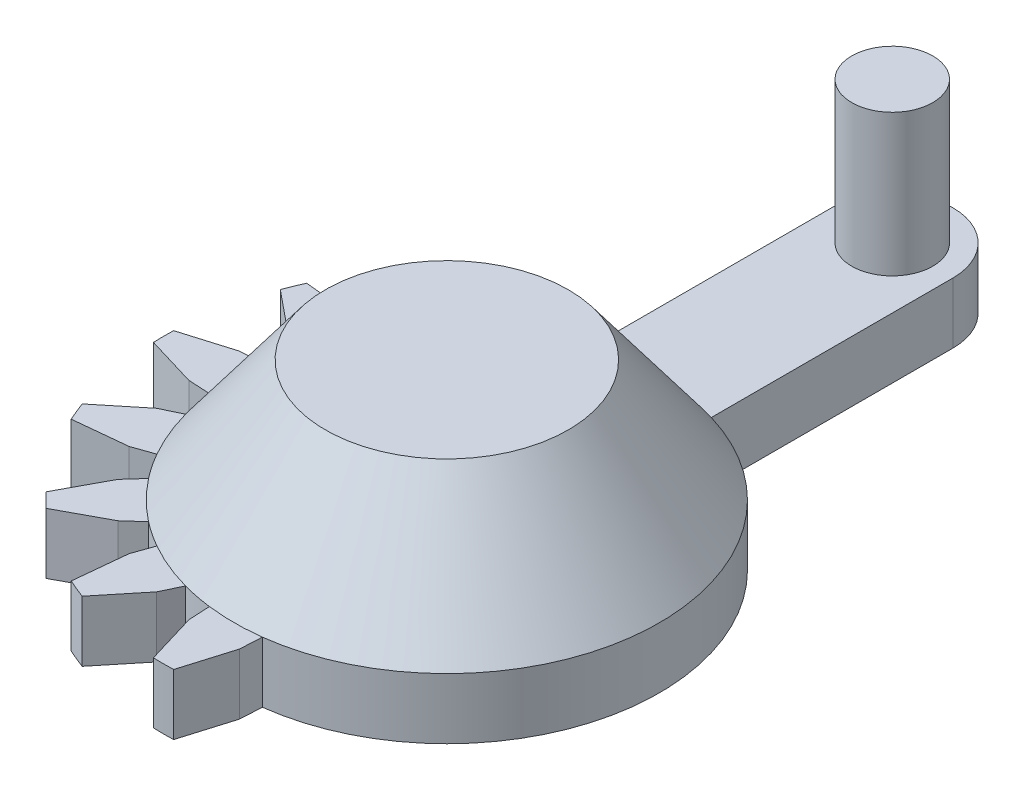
ISO-10303-21;
HEADER;
FILE_DESCRIPTION(('STEP AP214'),'2;1');
FILE_NAME('part.step','',(''),(''),'','','');
FILE_SCHEMA(('AUTOMOTIVE_DESIGN { 1 0 10303 214 1 1 1 1 }'));
ENDSEC;
DATA;
#1=APPLICATION_CONTEXT('core data for automotive mechanical design processes');
#2=APPLICATION_PROTOCOL_DEFINITION('international standard','automotive_design',2000,#1);
#3=PRODUCT_CONTEXT('',#1,'mechanical');
#4=PRODUCT('Part','Part','',(#3));
#5=PRODUCT_RELATED_PRODUCT_CATEGORY('part','',(#4));
#6=PRODUCT_DEFINITION_FORMATION('','',#4);
#7=PRODUCT_DEFINITION_CONTEXT('part definition',#1,'design');
#8=PRODUCT_DEFINITION('design','',#6,#7);
#9=PRODUCT_DEFINITION_SHAPE('','',#8);
#10=(LENGTH_UNIT() NAMED_UNIT(*) SI_UNIT(.MILLI.,.METRE.));
#11=(NAMED_UNIT(*) PLANE_ANGLE_UNIT() SI_UNIT($,.RADIAN.));
#12=(NAMED_UNIT(*) SI_UNIT($,.STERADIAN.) SOLID_ANGLE_UNIT());
#13=UNCERTAINTY_MEASURE_WITH_UNIT(LENGTH_MEASURE(1.E-05),#10,'distance_accuracy_value','');
#14=(GEOMETRIC_REPRESENTATION_CONTEXT(3) GLOBAL_UNCERTAINTY_ASSIGNED_CONTEXT((#13)) GLOBAL_UNIT_ASSIGNED_CONTEXT((#10,
#11,#12)) REPRESENTATION_CONTEXT('',''));
#15=CARTESIAN_POINT('',(0.,0.,0.));
#16=DIRECTION('',(0.,0.,1.));
#17=DIRECTION('',(1.,0.,0.));
#18=AXIS2_PLACEMENT_3D('',#15,#16,#17);
#19=CARTESIAN_POINT('',(0.,10.,-22.));
#20=DIRECTION('',(0.,1.,0.));
#21=DIRECTION('',(0.,0.,1.));
#22=AXIS2_PLACEMENT_3D('',#19,#20,#21);
#23=PLANE('',#22);
#24=CARTESIAN_POINT('',(0.,10.,-22.));
#25=DIRECTION('',(0.,-1.,0.));
#26=DIRECTION('',(0.,0.,-1.));
#27=AXIS2_PLACEMENT_3D('',#24,#25,#26);
#28=CIRCLE('',#27,2.);
#29=CARTESIAN_POINT('',(0.,10.,-24.));
#30=VERTEX_POINT('',#29);
#31=EDGE_CURVE('E321',#30,#30,#28,.T.);
#32=ORIENTED_EDGE('',*,*,#31,.F.);
#33=EDGE_LOOP('',(#32));
#34=FACE_BOUND('',#33,.T.);
#35=ADVANCED_FACE('F17',(#34),#23,.T.);
#36=CARTESIAN_POINT('',(0.,9.,0.));
#37=DIRECTION('',(0.,1.,0.));
#38=DIRECTION('',(-1.,0.,0.));
#39=AXIS2_PLACEMENT_3D('',#36,#37,#38);
#40=CYLINDRICAL_SURFACE('',#39,10.5);
#41=DIRECTION('',(0.,1.,0.));
#42=VECTOR('',#41,1.);
#43=CARTESIAN_POINT('',(-9.12480861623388,3.,-5.19498486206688));
#44=LINE('',#43,#42);
#45=CARTESIAN_POINT('',(-9.12480861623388,0.,-5.19498486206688));
#46=VERTEX_POINT('',#45);
#47=CARTESIAN_POINT('',(-9.12480861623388,3.,-5.19498486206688));
#48=VERTEX_POINT('',#47);
#49=EDGE_CURVE('E260',#46,#48,#44,.T.);
#50=ORIENTED_EDGE('',*,*,#49,.T.);
#51=CARTESIAN_POINT('',(0.,3.,0.));
#52=DIRECTION('',(0.,1.,0.));
#53=DIRECTION('',(-1.,0.,0.));
#54=AXIS2_PLACEMENT_3D('',#51,#52,#53);
#55=CIRCLE('',#54,10.5);
#56=CARTESIAN_POINT('',(-8.29145326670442,3.,-6.44218928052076));
#57=VERTEX_POINT('',#56);
#58=EDGE_CURVE('E264',#48,#57,#55,.F.);
#59=ORIENTED_EDGE('',*,*,#58,.T.);
#60=DIRECTION('',(0.,1.,0.));
#61=VECTOR('',#60,1.);
#62=CARTESIAN_POINT('',(-8.29145326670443,3.,-6.44218928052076));
#63=LINE('',#62,#61);
#64=CARTESIAN_POINT('',(-8.29145326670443,0.,-6.44218928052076));
#65=VERTEX_POINT('',#64);
#66=EDGE_CURVE('E263',#57,#65,#63,.F.);
#67=ORIENTED_EDGE('',*,*,#66,.T.);
#68=CARTESIAN_POINT('',(0.,0.,0.));
#69=DIRECTION('',(0.,1.,0.));
#70=DIRECTION('',(-1.,0.,0.));
#71=AXIS2_PLACEMENT_3D('',#68,#69,#70);
#72=CIRCLE('',#71,10.5);
#73=EDGE_CURVE('E20',#65,#46,#72,.T.);
#74=ORIENTED_EDGE('',*,*,#73,.T.);
#75=EDGE_LOOP('',(#50,#59,#67,#74));
#76=FACE_BOUND('',#75,.T.);
#77=ADVANCED_FACE('F259',(#76),#40,.T.);
#78=CARTESIAN_POINT('',(0.,9.,0.));
#79=DIRECTION('',(0.,1.,0.));
#80=DIRECTION('',(-1.,0.,0.));
#81=AXIS2_PLACEMENT_3D('',#78,#79,#80);
#82=CYLINDRICAL_SURFACE('',#81,10.5);
#83=DIRECTION('',(0.,1.,0.));
#84=VECTOR('',#83,1.);
#85=CARTESIAN_POINT('',(-10.4182585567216,3.,-1.30762710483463));
#86=LINE('',#85,#84);
#87=CARTESIAN_POINT('',(-10.4182585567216,0.,-1.30762710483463));
#88=VERTEX_POINT('',#87);
#89=CARTESIAN_POINT('',(-10.4182585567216,3.,-1.30762710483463));
#90=VERTEX_POINT('',#89);
#91=EDGE_CURVE('E364',#88,#90,#86,.T.);
#92=ORIENTED_EDGE('',*,*,#91,.T.);
#93=CARTESIAN_POINT('',(0.,3.,0.));
#94=DIRECTION('',(0.,1.,0.));
#95=DIRECTION('',(-1.,0.,0.));
#96=AXIS2_PLACEMENT_3D('',#93,#94,#95);
#97=CIRCLE('',#96,10.5);
#98=CARTESIAN_POINT('',(-10.1256230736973,3.,-2.77880502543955));
#99=VERTEX_POINT('',#98);
#100=EDGE_CURVE('E369',#90,#99,#97,.F.);
#101=ORIENTED_EDGE('',*,*,#100,.T.);
#102=DIRECTION('',(0.,1.,0.));
#103=VECTOR('',#102,1.);
#104=CARTESIAN_POINT('',(-10.1256230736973,3.,-2.77880502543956));
#105=LINE('',#104,#103);
#106=CARTESIAN_POINT('',(-10.1256230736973,0.,-2.77880502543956));
#107=VERTEX_POINT('',#106);
#108=EDGE_CURVE('E372',#99,#107,#105,.F.);
#109=ORIENTED_EDGE('',*,*,#108,.T.);
#110=CARTESIAN_POINT('',(0.,0.,0.));
#111=DIRECTION('',(0.,1.,0.));
#112=DIRECTION('',(-1.,0.,0.));
#113=AXIS2_PLACEMENT_3D('',#110,#111,#112);
#114=CIRCLE('',#113,10.5);
#115=EDGE_CURVE('E371',#107,#88,#114,.T.);
#116=ORIENTED_EDGE('',*,*,#115,.T.);
#117=EDGE_LOOP('',(#92,#101,#109,#116));
#118=FACE_BOUND('',#117,.T.);
#119=ADVANCED_FACE('F456',(#118),#82,.T.);
#120=CARTESIAN_POINT('',(0.,9.,0.));
#121=DIRECTION('',(0.,1.,0.));
#122=DIRECTION('',(-1.,0.,0.));
#123=AXIS2_PLACEMENT_3D('',#120,#121,#122);
#124=CYLINDRICAL_SURFACE('',#123,10.5);
#125=DIRECTION('',(0.,1.,0.));
#126=VECTOR('',#125,1.);
#127=CARTESIAN_POINT('',(-10.1256230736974,3.,2.77880502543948));
#128=LINE('',#127,#126);
#129=CARTESIAN_POINT('',(-10.1256230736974,0.,2.77880502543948));
#130=VERTEX_POINT('',#129);
#131=CARTESIAN_POINT('',(-10.1256230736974,3.,2.77880502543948));
#132=VERTEX_POINT('',#131);
#133=EDGE_CURVE('E351',#130,#132,#128,.T.);
#134=ORIENTED_EDGE('',*,*,#133,.T.);
#135=CARTESIAN_POINT('',(0.,3.,0.));
#136=DIRECTION('',(0.,1.,0.));
#137=DIRECTION('',(-1.,0.,0.));
#138=AXIS2_PLACEMENT_3D('',#135,#136,#137);
#139=CIRCLE('',#138,10.5);
#140=CARTESIAN_POINT('',(-10.4182585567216,3.,1.30762710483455));
#141=VERTEX_POINT('',#140);
#142=EDGE_CURVE('E356',#132,#141,#139,.F.);
#143=ORIENTED_EDGE('',*,*,#142,.T.);
#144=DIRECTION('',(0.,1.,0.));
#145=VECTOR('',#144,1.);
#146=CARTESIAN_POINT('',(-10.4182585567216,3.,1.30762710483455));
#147=LINE('',#146,#145);
#148=CARTESIAN_POINT('',(-10.4182585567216,0.,1.30762710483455));
#149=VERTEX_POINT('',#148);
#150=EDGE_CURVE('E360',#141,#149,#147,.F.);
#151=ORIENTED_EDGE('',*,*,#150,.T.);
#152=CARTESIAN_POINT('',(0.,0.,0.));
#153=DIRECTION('',(0.,1.,0.));
#154=DIRECTION('',(-1.,0.,0.));
#155=AXIS2_PLACEMENT_3D('',#152,#153,#154);
#156=CIRCLE('',#155,10.5);
#157=EDGE_CURVE('E359',#149,#130,#156,.T.);
#158=ORIENTED_EDGE('',*,*,#157,.T.);
#159=EDGE_LOOP('',(#134,#143,#151,#158));
#160=FACE_BOUND('',#159,.T.);
#161=ADVANCED_FACE('F1416',(#160),#124,.T.);
#162=CARTESIAN_POINT('',(0.,9.,0.));
#163=DIRECTION('',(0.,1.,0.));
#164=DIRECTION('',(-1.,0.,0.));
#165=AXIS2_PLACEMENT_3D('',#162,#163,#164);
#166=CYLINDRICAL_SURFACE('',#165,10.5);
#167=DIRECTION('',(0.,1.,0.));
#168=VECTOR('',#167,1.);
#169=CARTESIAN_POINT('',(-8.29145326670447,3.,6.44218928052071));
#170=LINE('',#169,#168);
#171=CARTESIAN_POINT('',(-8.29145326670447,0.,6.4421892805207));
#172=VERTEX_POINT('',#171);
#173=CARTESIAN_POINT('',(-8.29145326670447,3.,6.4421892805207));
#174=VERTEX_POINT('',#173);
#175=EDGE_CURVE('E339',#172,#174,#170,.T.);
#176=ORIENTED_EDGE('',*,*,#175,.T.);
#177=CARTESIAN_POINT('',(0.,3.,0.));
#178=DIRECTION('',(0.,1.,0.));
#179=DIRECTION('',(-1.,0.,0.));
#180=AXIS2_PLACEMENT_3D('',#177,#178,#179);
#181=CIRCLE('',#180,10.5);
#182=CARTESIAN_POINT('',(-9.12480861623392,3.,5.19498486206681));
#183=VERTEX_POINT('',#182);
#184=EDGE_CURVE('E344',#174,#183,#181,.F.);
#185=ORIENTED_EDGE('',*,*,#184,.T.);
#186=DIRECTION('',(0.,1.,0.));
#187=VECTOR('',#186,1.);
#188=CARTESIAN_POINT('',(-9.12480861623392,3.,5.19498486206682));
#189=LINE('',#188,#187);
#190=CARTESIAN_POINT('',(-9.12480861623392,0.,5.19498486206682));
#191=VERTEX_POINT('',#190);
#192=EDGE_CURVE('E347',#183,#191,#189,.F.);
#193=ORIENTED_EDGE('',*,*,#192,.T.);
#194=CARTESIAN_POINT('',(0.,0.,0.));
#195=DIRECTION('',(0.,1.,0.));
#196=DIRECTION('',(-1.,0.,0.));
#197=AXIS2_PLACEMENT_3D('',#194,#195,#196);
#198=CIRCLE('',#197,10.5);
#199=EDGE_CURVE('E346',#191,#172,#198,.T.);
#200=ORIENTED_EDGE('',*,*,#199,.T.);
#201=EDGE_LOOP('',(#176,#185,#193,#200));
#202=FACE_BOUND('',#201,.T.);
#203=ADVANCED_FACE('F1407',(#202),#166,.T.);
#204=CARTESIAN_POINT('',(0.,9.,0.));
#205=DIRECTION('',(0.,1.,0.));
#206=DIRECTION('',(-1.,0.,0.));
#207=AXIS2_PLACEMENT_3D('',#204,#205,#206);
#208=CYLINDRICAL_SURFACE('',#207,10.5);
#209=DIRECTION('',(0.,1.,0.));
#210=VECTOR('',#209,1.);
#211=CARTESIAN_POINT('',(-5.19498486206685,3.,9.1248086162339));
#212=LINE('',#211,#210);
#213=CARTESIAN_POINT('',(-5.19498486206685,0.,9.1248086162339));
#214=VERTEX_POINT('',#213);
#215=CARTESIAN_POINT('',(-5.19498486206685,3.,9.1248086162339));
#216=VERTEX_POINT('',#215);
#217=EDGE_CURVE('E327',#214,#216,#212,.T.);
#218=ORIENTED_EDGE('',*,*,#217,.T.);
#219=CARTESIAN_POINT('',(0.,3.,0.));
#220=DIRECTION('',(0.,1.,0.));
#221=DIRECTION('',(-1.,0.,0.));
#222=AXIS2_PLACEMENT_3D('',#219,#220,#221);
#223=CIRCLE('',#222,10.5);
#224=CARTESIAN_POINT('',(-6.44218928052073,3.,8.29145326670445));
#225=VERTEX_POINT('',#224);
#226=EDGE_CURVE('E332',#216,#225,#223,.F.);
#227=ORIENTED_EDGE('',*,*,#226,.T.);
#228=DIRECTION('',(0.,1.,0.));
#229=VECTOR('',#228,1.);
#230=CARTESIAN_POINT('',(-6.44218928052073,3.,8.29145326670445));
#231=LINE('',#230,#229);
#232=CARTESIAN_POINT('',(-6.44218928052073,0.,8.29145326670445));
#233=VERTEX_POINT('',#232);
#234=EDGE_CURVE('E335',#225,#233,#231,.F.);
#235=ORIENTED_EDGE('',*,*,#234,.T.);
#236=CARTESIAN_POINT('',(0.,0.,0.));
#237=DIRECTION('',(0.,1.,0.));
#238=DIRECTION('',(-1.,0.,0.));
#239=AXIS2_PLACEMENT_3D('',#236,#237,#238);
#240=CIRCLE('',#239,10.5);
#241=EDGE_CURVE('E334',#233,#214,#240,.T.);
#242=ORIENTED_EDGE('',*,*,#241,.T.);
#243=EDGE_LOOP('',(#218,#227,#235,#242));
#244=FACE_BOUND('',#243,.T.);
#245=ADVANCED_FACE('F1398',(#244),#208,.T.);
#246=CARTESIAN_POINT('',(0.,9.,0.));
#247=DIRECTION('',(0.,1.,0.));
#248=DIRECTION('',(-1.,0.,0.));
#249=AXIS2_PLACEMENT_3D('',#246,#247,#248);
#250=CYLINDRICAL_SURFACE('',#249,10.5);
#251=DIRECTION('',(0.,1.,0.));
#252=VECTOR('',#251,1.);
#253=CARTESIAN_POINT('',(-1.30762710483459,3.,10.4182585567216));
#254=LINE('',#253,#252);
#255=CARTESIAN_POINT('',(-1.30762710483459,0.,10.4182585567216));
#256=VERTEX_POINT('',#255);
#257=CARTESIAN_POINT('',(-1.30762710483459,3.,10.4182585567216));
#258=VERTEX_POINT('',#257);
#259=EDGE_CURVE('E314',#256,#258,#254,.T.);
#260=ORIENTED_EDGE('',*,*,#259,.T.);
#261=CARTESIAN_POINT('',(0.,3.,0.));
#262=DIRECTION('',(0.,1.,0.));
#263=DIRECTION('',(-1.,0.,0.));
#264=AXIS2_PLACEMENT_3D('',#261,#262,#263);
#265=CIRCLE('',#264,10.5);
#266=CARTESIAN_POINT('',(-2.77880502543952,3.,10.1256230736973));
#267=VERTEX_POINT('',#266);
#268=EDGE_CURVE('E319',#258,#267,#265,.F.);
#269=ORIENTED_EDGE('',*,*,#268,.T.);
#270=DIRECTION('',(0.,1.,0.));
#271=VECTOR('',#270,1.);
#272=CARTESIAN_POINT('',(-2.77880502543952,3.,10.1256230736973));
#273=LINE('',#272,#271);
#274=CARTESIAN_POINT('',(-2.77880502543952,0.,10.1256230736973));
#275=VERTEX_POINT('',#274);
#276=EDGE_CURVE('E323',#267,#275,#273,.F.);
#277=ORIENTED_EDGE('',*,*,#276,.T.);
#278=CARTESIAN_POINT('',(0.,0.,0.));
#279=DIRECTION('',(0.,1.,0.));
#280=DIRECTION('',(-1.,0.,0.));
#281=AXIS2_PLACEMENT_3D('',#278,#279,#280);
#282=CIRCLE('',#281,10.5);
#283=EDGE_CURVE('E322',#275,#256,#282,.T.);
#284=ORIENTED_EDGE('',*,*,#283,.T.);
#285=EDGE_LOOP('',(#260,#269,#277,#284));
#286=FACE_BOUND('',#285,.T.);
#287=ADVANCED_FACE('F1389',(#286),#250,.T.);
#288=CARTESIAN_POINT('',(0.,10.,-22.));
#289=DIRECTION('',(0.,-1.,0.));
#290=DIRECTION('',(0.,0.,-1.));
#291=AXIS2_PLACEMENT_3D('',#288,#289,#290);
#292=CYLINDRICAL_SURFACE('',#291,2.);
#293=CARTESIAN_POINT('',(0.,3.,-22.));
#294=DIRECTION('',(0.,-1.,0.));
#295=DIRECTION('',(0.,0.,-1.));
#296=AXIS2_PLACEMENT_3D('',#293,#294,#295);
#297=CIRCLE('',#296,2.);
#298=CARTESIAN_POINT('',(0.,3.,-24.));
#299=VERTEX_POINT('',#298);
#300=EDGE_CURVE('E403',#299,#299,#297,.T.);
#301=ORIENTED_EDGE('',*,*,#300,.F.);
#302=EDGE_LOOP('',(#301));
#303=FACE_BOUND('',#302,.T.);
#304=ORIENTED_EDGE('',*,*,#31,.T.);
#305=EDGE_LOOP('',(#304));
#306=FACE_BOUND('',#305,.T.);
#307=ADVANCED_FACE('F1380',(#303,#306),#292,.T.);
#308=CARTESIAN_POINT('',(5.99999999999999,9.,0.));
#309=DIRECTION('',(0.,-1.,0.));
#310=DIRECTION('',(1.,0.,0.));
#311=AXIS2_PLACEMENT_3D('',#308,#309,#310);
#312=PLANE('',#311);
#313=CARTESIAN_POINT('',(0.,9.,0.));
#314=DIRECTION('',(0.,-1.,0.));
#315=DIRECTION('',(0.,0.,-1.));
#316=AXIS2_PLACEMENT_3D('',#313,#314,#315);
#317=CIRCLE('',#316,6.);
#318=CARTESIAN_POINT('',(0.,9.,-6.));
#319=VERTEX_POINT('',#318);
#320=EDGE_CURVE('E399',#319,#319,#317,.T.);
#321=ORIENTED_EDGE('',*,*,#320,.F.);
#322=EDGE_LOOP('',(#321));
#323=FACE_BOUND('',#322,.T.);
#324=ADVANCED_FACE('F1372',(#323),#312,.F.);
#325=CARTESIAN_POINT('',(0.,3.,0.));
#326=DIRECTION('',(0.,-1.,0.));
#327=DIRECTION('',(1.,0.,0.));
#328=AXIS2_PLACEMENT_3D('',#325,#326,#327);
#329=CYLINDRICAL_SURFACE('',#328,14.);
#330=CARTESIAN_POINT('',(0.,3.,0.));
#331=DIRECTION('',(0.,-1.,0.));
#332=DIRECTION('',(1.,0.,0.));
#333=AXIS2_PLACEMENT_3D('',#330,#331,#332);
#334=CIRCLE('',#333,14.);
#335=CARTESIAN_POINT('',(-9.53962607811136,3.,-10.246732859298));
#336=VERTEX_POINT('',#335);
#337=CARTESIAN_POINT('',(-10.2467328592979,3.,-9.53962607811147));
#338=VERTEX_POINT('',#337);
#339=EDGE_CURVE('E297',#336,#338,#334,.F.);
#340=ORIENTED_EDGE('',*,*,#339,.F.);
#341=DIRECTION('',(0.,1.,0.));
#342=VECTOR('',#341,1.);
#343=CARTESIAN_POINT('',(-9.53962607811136,3.,-10.246732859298));
#344=LINE('',#343,#342);
#345=CARTESIAN_POINT('',(-9.53962607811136,0.,-10.246732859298));
#346=VERTEX_POINT('',#345);
#347=EDGE_CURVE('E310',#336,#346,#344,.F.);
#348=ORIENTED_EDGE('',*,*,#347,.T.);
#349=CARTESIAN_POINT('',(0.,0.,0.));
#350=DIRECTION('',(0.,-1.,0.));
#351=DIRECTION('',(1.,0.,0.));
#352=AXIS2_PLACEMENT_3D('',#349,#350,#351);
#353=CIRCLE('',#352,14.);
#354=CARTESIAN_POINT('',(-10.2467328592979,0.,-9.53962607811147));
#355=VERTEX_POINT('',#354);
#356=EDGE_CURVE('E447',#346,#355,#353,.F.);
#357=ORIENTED_EDGE('',*,*,#356,.T.);
#358=DIRECTION('',(0.,1.,0.));
#359=VECTOR('',#358,1.);
#360=CARTESIAN_POINT('',(-10.2467328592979,3.,-9.53962607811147));
#361=LINE('',#360,#359);
#362=EDGE_CURVE('E304',#355,#338,#361,.T.);
#363=ORIENTED_EDGE('',*,*,#362,.T.);
#364=EDGE_LOOP('',(#340,#348,#357,#363));
#365=FACE_BOUND('',#364,.T.);
#366=ADVANCED_FACE('F930',(#365),#329,.T.);
#367=CARTESIAN_POINT('',(0.,3.,0.));
#368=DIRECTION('',(0.,1.,0.));
#369=DIRECTION('',(-1.,0.,0.));
#370=AXIS2_PLACEMENT_3D('',#367,#368,#369);
#371=PLANE('',#370);
#372=DIRECTION('',(0.744017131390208,0.,0.668160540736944));
#373=VECTOR('',#372,1.);
#374=CARTESIAN_POINT('',(-7.24152903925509,3.,-9.00929599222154));
#375=LINE('',#374,#373);
#376=CARTESIAN_POINT('',(-6.44218928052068,3.,-8.29145326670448));
#377=VERTEX_POINT('',#376);
#378=CARTESIAN_POINT('',(-7.24152903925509,3.,-9.00929599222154));
#379=VERTEX_POINT('',#378);
#380=EDGE_CURVE('E406',#377,#379,#375,.F.);
#381=ORIENTED_EDGE('',*,*,#380,.T.);
#382=DIRECTION('',(0.880471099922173,0.,0.474099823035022));
#383=VECTOR('',#382,1.);
#384=CARTESIAN_POINT('',(-9.53962607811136,3.,-10.246732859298));
#385=LINE('',#384,#383);
#386=EDGE_CURVE('E307',#379,#336,#385,.F.);
#387=ORIENTED_EDGE('',*,*,#386,.T.);
#388=ORIENTED_EDGE('',*,*,#339,.T.);
#389=DIRECTION('',(-0.474099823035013,0.,-0.880471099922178));
#390=VECTOR('',#389,1.);
#391=CARTESIAN_POINT('',(-10.2467328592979,3.,-9.53962607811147));
#392=LINE('',#391,#390);
#393=CARTESIAN_POINT('',(-9.00929599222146,3.,-7.24152903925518));
#394=VERTEX_POINT('',#393);
#395=EDGE_CURVE('E300',#338,#394,#392,.F.);
#396=ORIENTED_EDGE('',*,*,#395,.T.);
#397=DIRECTION('',(-0.668160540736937,0.,-0.744017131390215));
#398=VECTOR('',#397,1.);
#399=CARTESIAN_POINT('',(-9.00929599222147,3.,-7.24152903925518));
#400=LINE('',#399,#398);
#401=EDGE_CURVE('E294',#394,#57,#400,.F.);
#402=ORIENTED_EDGE('',*,*,#401,.T.);
#403=CARTESIAN_POINT('',(0.,3.,0.));
#404=DIRECTION('',(0.,-1.,0.));
#405=DIRECTION('',(0.,0.,-1.));
#406=AXIS2_PLACEMENT_3D('',#403,#404,#405);
#407=CIRCLE('',#406,10.5);
#408=EDGE_CURVE('E394',#377,#57,#407,.F.);
#409=ORIENTED_EDGE('',*,*,#408,.F.);
#410=EDGE_LOOP('',(#381,#387,#388,#396,#402,#409));
#411=FACE_BOUND('',#410,.T.);
#412=ADVANCED_FACE('F864',(#411),#371,.T.);
#413=CARTESIAN_POINT('',(-9.00929599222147,3.,-7.24152903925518));
#414=DIRECTION('',(0.744017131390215,0.,-0.668160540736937));
#415=DIRECTION('',(-0.668160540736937,0.,-0.744017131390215));
#416=AXIS2_PLACEMENT_3D('',#413,#414,#415);
#417=PLANE('',#416);
#418=ORIENTED_EDGE('',*,*,#66,.F.);
#419=ORIENTED_EDGE('',*,*,#401,.F.);
#420=DIRECTION('',(0.,1.,0.));
#421=VECTOR('',#420,1.);
#422=CARTESIAN_POINT('',(-9.00929599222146,3.,-7.24152903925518));
#423=LINE('',#422,#421);
#424=CARTESIAN_POINT('',(-9.00929599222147,0.,-7.24152903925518));
#425=VERTEX_POINT('',#424);
#426=EDGE_CURVE('E303',#394,#425,#423,.F.);
#427=ORIENTED_EDGE('',*,*,#426,.T.);
#428=DIRECTION('',(-0.668160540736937,0.,-0.744017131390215));
#429=VECTOR('',#428,1.);
#430=CARTESIAN_POINT('',(-9.00929599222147,0.,-7.24152903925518));
#431=LINE('',#430,#429);
#432=EDGE_CURVE('E274',#65,#425,#431,.T.);
#433=ORIENTED_EDGE('',*,*,#432,.F.);
#434=EDGE_LOOP('',(#418,#419,#427,#433));
#435=FACE_BOUND('',#434,.T.);
#436=ADVANCED_FACE('F924',(#435),#417,.F.);
#437=CARTESIAN_POINT('',(-10.1380087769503,3.,-5.55229098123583));
#438=DIRECTION('',(-0.332576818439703,0.,0.943076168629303));
#439=DIRECTION('',(0.943076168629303,0.,0.332576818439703));
#440=AXIS2_PLACEMENT_3D('',#437,#438,#439);
#441=PLANE('',#440);
#442=DIRECTION('',(0.,1.,0.));
#443=VECTOR('',#442,1.);
#444=CARTESIAN_POINT('',(-10.1380087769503,3.,-5.55229098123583));
#445=LINE('',#444,#443);
#446=CARTESIAN_POINT('',(-10.1380087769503,0.,-5.55229098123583));
#447=VERTEX_POINT('',#446);
#448=CARTESIAN_POINT('',(-10.1380087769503,3.,-5.55229098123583));
#449=VERTEX_POINT('',#448);
#450=EDGE_CURVE('E498',#447,#449,#445,.T.);
#451=ORIENTED_EDGE('',*,*,#450,.T.);
#452=DIRECTION('',(-0.943076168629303,0.,-0.332576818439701));
#453=VECTOR('',#452,1.);
#454=CARTESIAN_POINT('',(-9.12480861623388,3.,-5.19498486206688));
#455=LINE('',#454,#453);
#456=EDGE_CURVE('E272',#48,#449,#455,.T.);
#457=ORIENTED_EDGE('',*,*,#456,.F.);
#458=ORIENTED_EDGE('',*,*,#49,.F.);
#459=DIRECTION('',(0.943076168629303,0.,0.332576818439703));
#460=VECTOR('',#459,1.);
#461=CARTESIAN_POINT('',(-10.1380087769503,0.,-5.55229098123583));
#462=LINE('',#461,#460);
#463=EDGE_CURVE('E269',#447,#46,#462,.T.);
#464=ORIENTED_EDGE('',*,*,#463,.F.);
#465=EDGE_LOOP('',(#451,#457,#458,#464));
#466=FACE_BOUND('',#465,.T.);
#467=ADVANCED_FACE('F268',(#466),#441,.F.);
#468=CARTESIAN_POINT('',(0.,3.,0.));
#469=DIRECTION('',(0.,-1.,0.));
#470=DIRECTION('',(1.,0.,0.));
#471=AXIS2_PLACEMENT_3D('',#468,#469,#470);
#472=CYLINDRICAL_SURFACE('',#471,14.);
#473=CARTESIAN_POINT('',(0.,3.,0.));
#474=DIRECTION('',(0.,-1.,0.));
#475=DIRECTION('',(1.,0.,0.));
#476=AXIS2_PLACEMENT_3D('',#473,#474,#475);
#477=CIRCLE('',#476,14.);
#478=CARTESIAN_POINT('',(-12.7347201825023,3.,-5.8160899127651));
#479=VERTEX_POINT('',#478);
#480=CARTESIAN_POINT('',(-13.1174036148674,3.,-4.89221038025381));
#481=VERTEX_POINT('',#480);
#482=EDGE_CURVE('E283',#479,#481,#477,.F.);
#483=ORIENTED_EDGE('',*,*,#482,.F.);
#484=DIRECTION('',(0.,1.,0.));
#485=VECTOR('',#484,1.);
#486=CARTESIAN_POINT('',(-12.7347201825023,3.,-5.8160899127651));
#487=LINE('',#486,#485);
#488=CARTESIAN_POINT('',(-12.7347201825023,0.,-5.8160899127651));
#489=VERTEX_POINT('',#488);
#490=EDGE_CURVE('E497',#479,#489,#487,.F.);
#491=ORIENTED_EDGE('',*,*,#490,.T.);
#492=CARTESIAN_POINT('',(0.,0.,0.));
#493=DIRECTION('',(0.,-1.,0.));
#494=DIRECTION('',(1.,0.,0.));
#495=AXIS2_PLACEMENT_3D('',#492,#493,#494);
#496=CIRCLE('',#495,14.);
#497=CARTESIAN_POINT('',(-13.1174036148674,0.,-4.89221038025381));
#498=VERTEX_POINT('',#497);
#499=EDGE_CURVE('E281',#489,#498,#496,.F.);
#500=ORIENTED_EDGE('',*,*,#499,.T.);
#501=DIRECTION('',(0.,1.,0.));
#502=VECTOR('',#501,1.);
#503=CARTESIAN_POINT('',(-13.1174036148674,3.,-4.89221038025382));
#504=LINE('',#503,#502);
#505=EDGE_CURVE('E490',#498,#481,#504,.T.);
#506=ORIENTED_EDGE('',*,*,#505,.T.);
#507=EDGE_LOOP('',(#483,#491,#500,#506));
#508=FACE_BOUND('',#507,.T.);
#509=ADVANCED_FACE('F700',(#508),#472,.T.);
#510=CARTESIAN_POINT('',(0.,3.,0.));
#511=DIRECTION('',(0.,1.,0.));
#512=DIRECTION('',(-1.,0.,0.));
#513=AXIS2_PLACEMENT_3D('',#510,#511,#512);
#514=PLANE('',#513);
#515=ORIENTED_EDGE('',*,*,#456,.T.);
#516=DIRECTION('',(0.994879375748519,0.,0.101069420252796));
#517=VECTOR('',#516,1.);
#518=CARTESIAN_POINT('',(-12.7347201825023,3.,-5.8160899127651));
#519=LINE('',#518,#517);
#520=EDGE_CURVE('E495',#449,#479,#519,.F.);
#521=ORIENTED_EDGE('',*,*,#520,.T.);
#522=ORIENTED_EDGE('',*,*,#482,.T.);
#523=DIRECTION('',(-0.774952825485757,0.,-0.632019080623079));
#524=VECTOR('',#523,1.);
#525=CARTESIAN_POINT('',(-13.1174036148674,3.,-4.89221038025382));
#526=LINE('',#525,#524);
#527=CARTESIAN_POINT('',(-11.094717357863,3.,-3.24259214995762));
#528=VERTEX_POINT('',#527);
#529=EDGE_CURVE('E486',#481,#528,#526,.F.);
#530=ORIENTED_EDGE('',*,*,#529,.T.);
#531=DIRECTION('',(-0.902022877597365,0.,-0.431688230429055));
#532=VECTOR('',#531,1.);
#533=CARTESIAN_POINT('',(-11.094717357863,3.,-3.24259214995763));
#534=LINE('',#533,#532);
#535=EDGE_CURVE('E374',#528,#99,#534,.F.);
#536=ORIENTED_EDGE('',*,*,#535,.T.);
#537=CARTESIAN_POINT('',(0.,3.,0.));
#538=DIRECTION('',(0.,-1.,0.));
#539=DIRECTION('',(0.,0.,-1.));
#540=AXIS2_PLACEMENT_3D('',#537,#538,#539);
#541=CIRCLE('',#540,10.5);
#542=EDGE_CURVE('E391',#48,#99,#541,.F.);
#543=ORIENTED_EDGE('',*,*,#542,.F.);
#544=EDGE_LOOP('',(#515,#521,#522,#530,#536,#543));
#545=FACE_BOUND('',#544,.T.);
#546=ADVANCED_FACE('F1328',(#545),#514,.T.);
#547=CARTESIAN_POINT('',(-11.094717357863,3.,-3.24259214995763));
#548=DIRECTION('',(0.431688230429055,0.,-0.902022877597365));
#549=DIRECTION('',(-0.902022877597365,0.,-0.431688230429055));
#550=AXIS2_PLACEMENT_3D('',#547,#548,#549);
#551=PLANE('',#550);
#552=ORIENTED_EDGE('',*,*,#108,.F.);
#553=ORIENTED_EDGE('',*,*,#535,.F.);
#554=DIRECTION('',(0.,1.,0.));
#555=VECTOR('',#554,1.);
#556=CARTESIAN_POINT('',(-11.094717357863,3.,-3.24259214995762));
#557=LINE('',#556,#555);
#558=CARTESIAN_POINT('',(-11.094717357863,0.,-3.24259214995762));
#559=VERTEX_POINT('',#558);
#560=EDGE_CURVE('E489',#528,#559,#557,.F.);
#561=ORIENTED_EDGE('',*,*,#560,.T.);
#562=DIRECTION('',(-0.902022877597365,0.,-0.431688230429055));
#563=VECTOR('',#562,1.);
#564=CARTESIAN_POINT('',(-11.094717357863,0.,-3.24259214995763));
#565=LINE('',#564,#563);
#566=EDGE_CURVE('E368',#107,#559,#565,.T.);
#567=ORIENTED_EDGE('',*,*,#566,.F.);
#568=EDGE_LOOP('',(#552,#553,#561,#567));
#569=FACE_BOUND('',#568,.T.);
#570=ADVANCED_FACE('F1320',(#569),#551,.F.);
#571=CARTESIAN_POINT('',(-11.4910685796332,3.,-1.25000000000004));
#572=DIRECTION('',(0.0536387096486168,0.,0.998560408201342));
#573=DIRECTION('',(0.998560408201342,0.,-0.0536387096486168));
#574=AXIS2_PLACEMENT_3D('',#571,#572,#573);
#575=PLANE('',#574);
#576=DIRECTION('',(0.,1.,0.));
#577=VECTOR('',#576,1.);
#578=CARTESIAN_POINT('',(-11.4910685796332,3.,-1.25000000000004));
#579=LINE('',#578,#577);
#580=CARTESIAN_POINT('',(-11.4910685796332,0.,-1.25000000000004));
#581=VERTEX_POINT('',#580);
#582=CARTESIAN_POINT('',(-11.4910685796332,3.,-1.25000000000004));
#583=VERTEX_POINT('',#582);
#584=EDGE_CURVE('E684',#581,#583,#579,.T.);
#585=ORIENTED_EDGE('',*,*,#584,.T.);
#586=DIRECTION('',(-0.998560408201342,0.,0.0536387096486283));
#587=VECTOR('',#586,1.);
#588=CARTESIAN_POINT('',(-10.4182585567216,3.,-1.30762710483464));
#589=LINE('',#588,#587);
#590=EDGE_CURVE('E442',#90,#583,#589,.T.);
#591=ORIENTED_EDGE('',*,*,#590,.F.);
#592=ORIENTED_EDGE('',*,*,#91,.F.);
#593=DIRECTION('',(0.998560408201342,0.,-0.0536387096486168));
#594=VECTOR('',#593,1.);
#595=CARTESIAN_POINT('',(-11.4910685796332,0.,-1.25000000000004));
#596=LINE('',#595,#594);
#597=EDGE_CURVE('E367',#581,#88,#596,.T.);
#598=ORIENTED_EDGE('',*,*,#597,.F.);
#599=EDGE_LOOP('',(#585,#591,#592,#598));
#600=FACE_BOUND('',#599,.T.);
#601=ADVANCED_FACE('F465',(#600),#575,.F.);
#602=CARTESIAN_POINT('',(0.,3.,0.));
#603=DIRECTION('',(0.,-1.,0.));
#604=DIRECTION('',(0.,0.,-1.));
#605=AXIS2_PLACEMENT_3D('',#602,#603,#604);
#606=CYLINDRICAL_SURFACE('',#605,14.);
#607=CARTESIAN_POINT('',(0.,3.,0.));
#608=DIRECTION('',(0.,-1.,0.));
#609=DIRECTION('',(0.,0.,-1.));
#610=AXIS2_PLACEMENT_3D('',#607,#608,#609);
#611=CIRCLE('',#610,14.);
#612=CARTESIAN_POINT('',(-13.9910685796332,3.,-0.500000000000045));
#613=VERTEX_POINT('',#612);
#614=CARTESIAN_POINT('',(-13.9910685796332,3.,0.499999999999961));
#615=VERTEX_POINT('',#614);
#616=EDGE_CURVE('E440',#613,#615,#611,.F.);
#617=ORIENTED_EDGE('',*,*,#616,.F.);
#618=DIRECTION('',(0.,1.,0.));
#619=VECTOR('',#618,1.);
#620=CARTESIAN_POINT('',(-13.9910685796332,3.,-0.500000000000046));
#621=LINE('',#620,#619);
#622=CARTESIAN_POINT('',(-13.9910685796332,0.,-0.500000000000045));
#623=VERTEX_POINT('',#622);
#624=EDGE_CURVE('E683',#613,#623,#621,.F.);
#625=ORIENTED_EDGE('',*,*,#624,.T.);
#626=CARTESIAN_POINT('',(0.,0.,0.));
#627=DIRECTION('',(0.,-1.,0.));
#628=DIRECTION('',(0.,0.,-1.));
#629=AXIS2_PLACEMENT_3D('',#626,#627,#628);
#630=CIRCLE('',#629,14.);
#631=CARTESIAN_POINT('',(-13.9910685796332,0.,0.499999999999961));
#632=VERTEX_POINT('',#631);
#633=EDGE_CURVE('E443',#623,#632,#630,.F.);
#634=ORIENTED_EDGE('',*,*,#633,.T.);
#635=DIRECTION('',(0.,1.,0.));
#636=VECTOR('',#635,1.);
#637=CARTESIAN_POINT('',(-13.9910685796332,3.,0.499999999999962));
#638=LINE('',#637,#636);
#639=EDGE_CURVE('E676',#632,#615,#638,.T.);
#640=ORIENTED_EDGE('',*,*,#639,.T.);
#641=EDGE_LOOP('',(#617,#625,#634,#640));
#642=FACE_BOUND('',#641,.T.);
#643=ADVANCED_FACE('F1304',(#642),#606,.T.);
#644=CARTESIAN_POINT('',(0.,3.,0.));
#645=DIRECTION('',(0.,1.,0.));
#646=DIRECTION('',(0.,0.,1.));
#647=AXIS2_PLACEMENT_3D('',#644,#645,#646);
#648=PLANE('',#647);
#649=ORIENTED_EDGE('',*,*,#590,.T.);
#650=DIRECTION('',(0.957826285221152,0.,-0.287347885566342));
#651=VECTOR('',#650,1.);
#652=CARTESIAN_POINT('',(-13.9910685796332,3.,-0.500000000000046));
#653=LINE('',#652,#651);
#654=EDGE_CURVE('E681',#583,#613,#653,.F.);
#655=ORIENTED_EDGE('',*,*,#654,.T.);
#656=ORIENTED_EDGE('',*,*,#616,.T.);
#657=DIRECTION('',(-0.957826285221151,0.,-0.287347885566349));
#658=VECTOR('',#657,1.);
#659=CARTESIAN_POINT('',(-13.9910685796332,3.,0.499999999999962));
#660=LINE('',#659,#658);
#661=CARTESIAN_POINT('',(-11.4910685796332,3.,1.24999999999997));
#662=VERTEX_POINT('',#661);
#663=EDGE_CURVE('E672',#615,#662,#660,.F.);
#664=ORIENTED_EDGE('',*,*,#663,.T.);
#665=DIRECTION('',(-0.998560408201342,0.,-0.0536387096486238));
#666=VECTOR('',#665,1.);
#667=CARTESIAN_POINT('',(-11.4910685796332,3.,1.24999999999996));
#668=LINE('',#667,#666);
#669=EDGE_CURVE('E363',#662,#141,#668,.F.);
#670=ORIENTED_EDGE('',*,*,#669,.T.);
#671=CARTESIAN_POINT('',(0.,2.99999999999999,0.));
#672=DIRECTION('',(0.,-1.,0.));
#673=DIRECTION('',(0.,0.,-1.));
#674=AXIS2_PLACEMENT_3D('',#671,#672,#673);
#675=CIRCLE('',#674,10.5);
#676=EDGE_CURVE('E389',#90,#141,#675,.F.);
#677=ORIENTED_EDGE('',*,*,#676,.F.);
#678=EDGE_LOOP('',(#649,#655,#656,#664,#670,#677));
#679=FACE_BOUND('',#678,.T.);
#680=ADVANCED_FACE('F1296',(#679),#648,.T.);
#681=CARTESIAN_POINT('',(-11.4910685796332,3.,1.24999999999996));
#682=DIRECTION('',(0.0536387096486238,0.,-0.998560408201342));
#683=DIRECTION('',(-0.998560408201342,0.,-0.0536387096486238));
#684=AXIS2_PLACEMENT_3D('',#681,#682,#683);
#685=PLANE('',#684);
#686=ORIENTED_EDGE('',*,*,#150,.F.);
#687=ORIENTED_EDGE('',*,*,#669,.F.);
#688=DIRECTION('',(0.,1.,0.));
#689=VECTOR('',#688,1.);
#690=CARTESIAN_POINT('',(-11.4910685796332,3.,1.24999999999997));
#691=LINE('',#690,#689);
#692=CARTESIAN_POINT('',(-11.4910685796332,0.,1.24999999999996));
#693=VERTEX_POINT('',#692);
#694=EDGE_CURVE('E675',#662,#693,#691,.F.);
#695=ORIENTED_EDGE('',*,*,#694,.T.);
#696=DIRECTION('',(-0.998560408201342,0.,-0.0536387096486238));
#697=VECTOR('',#696,1.);
#698=CARTESIAN_POINT('',(-11.4910685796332,0.,1.24999999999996));
#699=LINE('',#698,#697);
#700=EDGE_CURVE('E355',#149,#693,#699,.T.);
#701=ORIENTED_EDGE('',*,*,#700,.F.);
#702=EDGE_LOOP('',(#686,#687,#695,#701));
#703=FACE_BOUND('',#702,.T.);
#704=ADVANCED_FACE('F797',(#703),#685,.F.);
#705=CARTESIAN_POINT('',(-11.094717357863,3.,3.24259214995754));
#706=DIRECTION('',(0.431688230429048,0.,0.902022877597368));
#707=DIRECTION('',(0.902022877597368,0.,-0.431688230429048));
#708=AXIS2_PLACEMENT_3D('',#705,#706,#707);
#709=PLANE('',#708);
#710=DIRECTION('',(0.,1.,0.));
#711=VECTOR('',#710,1.);
#712=CARTESIAN_POINT('',(-11.094717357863,3.,3.24259214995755));
#713=LINE('',#712,#711);
#714=CARTESIAN_POINT('',(-11.094717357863,0.,3.24259214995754));
#715=VERTEX_POINT('',#714);
#716=CARTESIAN_POINT('',(-11.094717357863,3.,3.24259214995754));
#717=VERTEX_POINT('',#716);
#718=EDGE_CURVE('E657',#715,#717,#713,.T.);
#719=ORIENTED_EDGE('',*,*,#718,.T.);
#720=DIRECTION('',(-0.902022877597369,0.,0.431688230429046));
#721=VECTOR('',#720,1.);
#722=CARTESIAN_POINT('',(-10.1256230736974,3.,2.77880502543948));
#723=LINE('',#722,#721);
#724=EDGE_CURVE('E437',#132,#717,#723,.T.);
#725=ORIENTED_EDGE('',*,*,#724,.F.);
#726=ORIENTED_EDGE('',*,*,#133,.F.);
#727=DIRECTION('',(0.902022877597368,0.,-0.431688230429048));
#728=VECTOR('',#727,1.);
#729=CARTESIAN_POINT('',(-11.094717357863,0.,3.24259214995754));
#730=LINE('',#729,#728);
#731=EDGE_CURVE('E354',#715,#130,#730,.T.);
#732=ORIENTED_EDGE('',*,*,#731,.F.);
#733=EDGE_LOOP('',(#719,#725,#726,#732));
#734=FACE_BOUND('',#733,.T.);
#735=ADVANCED_FACE('F1279',(#734),#709,.F.);
#736=CARTESIAN_POINT('',(0.,3.,0.));
#737=DIRECTION('',(0.,-1.,0.));
#738=DIRECTION('',(0.,0.,-1.));
#739=AXIS2_PLACEMENT_3D('',#736,#737,#738);
#740=CYLINDRICAL_SURFACE('',#739,14.);
#741=CARTESIAN_POINT('',(0.,3.,0.));
#742=DIRECTION('',(0.,-1.,0.));
#743=DIRECTION('',(0.,0.,-1.));
#744=AXIS2_PLACEMENT_3D('',#741,#742,#743);
#745=CIRCLE('',#744,14.);
#746=CARTESIAN_POINT('',(-13.1174036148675,3.,4.89221038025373));
#747=VERTEX_POINT('',#746);
#748=CARTESIAN_POINT('',(-12.7347201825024,3.,5.81608991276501));
#749=VERTEX_POINT('',#748);
#750=EDGE_CURVE('E435',#747,#749,#745,.F.);
#751=ORIENTED_EDGE('',*,*,#750,.F.);
#752=DIRECTION('',(0.,1.,0.));
#753=VECTOR('',#752,1.);
#754=CARTESIAN_POINT('',(-13.1174036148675,3.,4.89221038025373));
#755=LINE('',#754,#753);
#756=CARTESIAN_POINT('',(-13.1174036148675,0.,4.89221038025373));
#757=VERTEX_POINT('',#756);
#758=EDGE_CURVE('E656',#747,#757,#755,.F.);
#759=ORIENTED_EDGE('',*,*,#758,.T.);
#760=CARTESIAN_POINT('',(0.,0.,0.));
#761=DIRECTION('',(0.,-1.,0.));
#762=DIRECTION('',(0.,0.,-1.));
#763=AXIS2_PLACEMENT_3D('',#760,#761,#762);
#764=CIRCLE('',#763,14.);
#765=CARTESIAN_POINT('',(-12.7347201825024,0.,5.81608991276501));
#766=VERTEX_POINT('',#765);
#767=EDGE_CURVE('E438',#757,#766,#764,.F.);
#768=ORIENTED_EDGE('',*,*,#767,.T.);
#769=DIRECTION('',(0.,1.,0.));
#770=VECTOR('',#769,1.);
#771=CARTESIAN_POINT('',(-12.7347201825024,3.,5.81608991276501));
#772=LINE('',#771,#770);
#773=EDGE_CURVE('E646',#766,#749,#772,.T.);
#774=ORIENTED_EDGE('',*,*,#773,.T.);
#775=EDGE_LOOP('',(#751,#759,#768,#774));
#776=FACE_BOUND('',#775,.T.);
#777=ADVANCED_FACE('F1270',(#776),#740,.T.);
#778=CARTESIAN_POINT('',(0.,3.,0.));
#779=DIRECTION('',(0.,1.,0.));
#780=DIRECTION('',(0.,0.,1.));
#781=AXIS2_PLACEMENT_3D('',#778,#779,#780);
#782=PLANE('',#781);
#783=ORIENTED_EDGE('',*,*,#724,.T.);
#784=DIRECTION('',(0.774952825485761,0.,-0.632019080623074));
#785=VECTOR('',#784,1.);
#786=CARTESIAN_POINT('',(-13.1174036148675,3.,4.89221038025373));
#787=LINE('',#786,#785);
#788=EDGE_CURVE('E653',#717,#747,#787,.F.);
#789=ORIENTED_EDGE('',*,*,#788,.T.);
#790=ORIENTED_EDGE('',*,*,#750,.T.);
#791=DIRECTION('',(-0.99487937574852,0.,0.101069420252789));
#792=VECTOR('',#791,1.);
#793=CARTESIAN_POINT('',(-12.7347201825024,3.,5.81608991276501));
#794=LINE('',#793,#792);
#795=CARTESIAN_POINT('',(-10.1380087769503,3.,5.55229098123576));
#796=VERTEX_POINT('',#795);
#797=EDGE_CURVE('E642',#749,#796,#794,.F.);
#798=ORIENTED_EDGE('',*,*,#797,.T.);
#799=DIRECTION('',(-0.943076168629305,0.,0.332576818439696));
#800=VECTOR('',#799,1.);
#801=CARTESIAN_POINT('',(-10.1380087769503,3.,5.55229098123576));
#802=LINE('',#801,#800);
#803=EDGE_CURVE('E350',#796,#183,#802,.F.);
#804=ORIENTED_EDGE('',*,*,#803,.T.);
#805=CARTESIAN_POINT('',(0.,3.,0.));
#806=DIRECTION('',(0.,-1.,0.));
#807=DIRECTION('',(0.,0.,-1.));
#808=AXIS2_PLACEMENT_3D('',#805,#806,#807);
#809=CIRCLE('',#808,10.5);
#810=EDGE_CURVE('E417',#132,#183,#809,.F.);
#811=ORIENTED_EDGE('',*,*,#810,.F.);
#812=EDGE_LOOP('',(#783,#789,#790,#798,#804,#811));
#813=FACE_BOUND('',#812,.T.);
#814=ADVANCED_FACE('F1261',(#813),#782,.T.);
#815=CARTESIAN_POINT('',(-10.1380087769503,3.,5.55229098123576));
#816=DIRECTION('',(-0.332576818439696,0.,-0.943076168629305));
#817=DIRECTION('',(-0.943076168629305,0.,0.332576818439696));
#818=AXIS2_PLACEMENT_3D('',#815,#816,#817);
#819=PLANE('',#818);
#820=ORIENTED_EDGE('',*,*,#192,.F.);
#821=ORIENTED_EDGE('',*,*,#803,.F.);
#822=DIRECTION('',(0.,1.,0.));
#823=VECTOR('',#822,1.);
#824=CARTESIAN_POINT('',(-10.1380087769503,3.,5.55229098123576));
#825=LINE('',#824,#823);
#826=CARTESIAN_POINT('',(-10.1380087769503,0.,5.55229098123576));
#827=VERTEX_POINT('',#826);
#828=EDGE_CURVE('E645',#796,#827,#825,.F.);
#829=ORIENTED_EDGE('',*,*,#828,.T.);
#830=DIRECTION('',(-0.943076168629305,0.,0.332576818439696));
#831=VECTOR('',#830,1.);
#832=CARTESIAN_POINT('',(-10.1380087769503,0.,5.55229098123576));
#833=LINE('',#832,#831);
#834=EDGE_CURVE('E343',#191,#827,#833,.T.);
#835=ORIENTED_EDGE('',*,*,#834,.F.);
#836=EDGE_LOOP('',(#820,#821,#829,#835));
#837=FACE_BOUND('',#836,.T.);
#838=ADVANCED_FACE('F1252',(#837),#819,.F.);
#839=CARTESIAN_POINT('',(-9.00929599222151,3.,7.24152903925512));
#840=DIRECTION('',(0.744017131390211,0.,0.668160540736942));
#841=DIRECTION('',(0.668160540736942,0.,-0.744017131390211));
#842=AXIS2_PLACEMENT_3D('',#839,#840,#841);
#843=PLANE('',#842);
#844=DIRECTION('',(0.,1.,0.));
#845=VECTOR('',#844,1.);
#846=CARTESIAN_POINT('',(-9.00929599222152,3.,7.24152903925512));
#847=LINE('',#846,#845);
#848=CARTESIAN_POINT('',(-9.00929599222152,0.,7.24152903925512));
#849=VERTEX_POINT('',#848);
#850=CARTESIAN_POINT('',(-9.00929599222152,3.,7.24152903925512));
#851=VERTEX_POINT('',#850);
#852=EDGE_CURVE('E627',#849,#851,#847,.T.);
#853=ORIENTED_EDGE('',*,*,#852,.T.);
#854=DIRECTION('',(-0.668160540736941,0.,0.744017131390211));
#855=VECTOR('',#854,1.);
#856=CARTESIAN_POINT('',(-8.29145326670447,3.,6.4421892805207));
#857=LINE('',#856,#855);
#858=EDGE_CURVE('E432',#174,#851,#857,.T.);
#859=ORIENTED_EDGE('',*,*,#858,.F.);
#860=ORIENTED_EDGE('',*,*,#175,.F.);
#861=DIRECTION('',(0.668160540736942,0.,-0.744017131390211));
#862=VECTOR('',#861,1.);
#863=CARTESIAN_POINT('',(-9.00929599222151,0.,7.24152903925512));
#864=LINE('',#863,#862);
#865=EDGE_CURVE('E342',#849,#172,#864,.T.);
#866=ORIENTED_EDGE('',*,*,#865,.F.);
#867=EDGE_LOOP('',(#853,#859,#860,#866));
#868=FACE_BOUND('',#867,.T.);
#869=ADVANCED_FACE('F1243',(#868),#843,.F.);
#870=CARTESIAN_POINT('',(0.,3.,0.));
#871=DIRECTION('',(0.,-1.,0.));
#872=DIRECTION('',(0.,0.,-1.));
#873=AXIS2_PLACEMENT_3D('',#870,#871,#872);
#874=CYLINDRICAL_SURFACE('',#873,14.);
#875=CARTESIAN_POINT('',(0.,3.,0.));
#876=DIRECTION('',(0.,-1.,0.));
#877=DIRECTION('',(0.,0.,-1.));
#878=AXIS2_PLACEMENT_3D('',#875,#876,#877);
#879=CIRCLE('',#878,14.);
#880=CARTESIAN_POINT('',(-10.246732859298,3.,9.5396260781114));
#881=VERTEX_POINT('',#880);
#882=CARTESIAN_POINT('',(-9.53962607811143,3.,10.2467328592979));
#883=VERTEX_POINT('',#882);
#884=EDGE_CURVE('E430',#881,#883,#879,.F.);
#885=ORIENTED_EDGE('',*,*,#884,.F.);
#886=DIRECTION('',(0.,1.,0.));
#887=VECTOR('',#886,1.);
#888=CARTESIAN_POINT('',(-10.246732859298,3.,9.5396260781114));
#889=LINE('',#888,#887);
#890=CARTESIAN_POINT('',(-10.246732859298,0.,9.5396260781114));
#891=VERTEX_POINT('',#890);
#892=EDGE_CURVE('E626',#881,#891,#889,.F.);
#893=ORIENTED_EDGE('',*,*,#892,.T.);
#894=CARTESIAN_POINT('',(0.,0.,0.));
#895=DIRECTION('',(0.,-1.,0.));
#896=DIRECTION('',(0.,0.,-1.));
#897=AXIS2_PLACEMENT_3D('',#894,#895,#896);
#898=CIRCLE('',#897,14.);
#899=CARTESIAN_POINT('',(-9.53962607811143,0.,10.2467328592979));
#900=VERTEX_POINT('',#899);
#901=EDGE_CURVE('E433',#891,#900,#898,.F.);
#902=ORIENTED_EDGE('',*,*,#901,.T.);
#903=DIRECTION('',(0.,1.,0.));
#904=VECTOR('',#903,1.);
#905=CARTESIAN_POINT('',(-9.53962607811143,3.,10.2467328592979));
#906=LINE('',#905,#904);
#907=EDGE_CURVE('E616',#900,#883,#906,.T.);
#908=ORIENTED_EDGE('',*,*,#907,.T.);
#909=EDGE_LOOP('',(#885,#893,#902,#908));
#910=FACE_BOUND('',#909,.T.);
#911=ADVANCED_FACE('F1234',(#910),#874,.T.);
#912=CARTESIAN_POINT('',(0.,3.,0.));
#913=DIRECTION('',(0.,1.,0.));
#914=DIRECTION('',(0.,0.,1.));
#915=AXIS2_PLACEMENT_3D('',#912,#913,#914);
#916=PLANE('',#915);
#917=ORIENTED_EDGE('',*,*,#858,.T.);
#918=DIRECTION('',(0.474099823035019,0.,-0.880471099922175));
#919=VECTOR('',#918,1.);
#920=CARTESIAN_POINT('',(-10.246732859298,3.,9.5396260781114));
#921=LINE('',#920,#919);
#922=EDGE_CURVE('E623',#851,#881,#921,.F.);
#923=ORIENTED_EDGE('',*,*,#922,.T.);
#924=ORIENTED_EDGE('',*,*,#884,.T.);
#925=DIRECTION('',(-0.880471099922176,0.,0.474099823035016));
#926=VECTOR('',#925,1.);
#927=CARTESIAN_POINT('',(-9.53962607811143,3.,10.2467328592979));
#928=LINE('',#927,#926);
#929=CARTESIAN_POINT('',(-7.24152903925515,3.,9.00929599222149));
#930=VERTEX_POINT('',#929);
#931=EDGE_CURVE('E612',#883,#930,#928,.F.);
#932=ORIENTED_EDGE('',*,*,#931,.T.);
#933=DIRECTION('',(-0.744017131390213,0.,0.668160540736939));
#934=VECTOR('',#933,1.);
#935=CARTESIAN_POINT('',(-7.24152903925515,3.,9.00929599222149));
#936=LINE('',#935,#934);
#937=EDGE_CURVE('E338',#930,#225,#936,.F.);
#938=ORIENTED_EDGE('',*,*,#937,.T.);
#939=CARTESIAN_POINT('',(0.,3.,0.));
#940=DIRECTION('',(0.,-1.,0.));
#941=DIRECTION('',(0.,0.,-1.));
#942=AXIS2_PLACEMENT_3D('',#939,#940,#941);
#943=CIRCLE('',#942,10.5);
#944=EDGE_CURVE('E414',#174,#225,#943,.F.);
#945=ORIENTED_EDGE('',*,*,#944,.F.);
#946=EDGE_LOOP('',(#917,#923,#924,#932,#938,#945));
#947=FACE_BOUND('',#946,.T.);
#948=ADVANCED_FACE('F1225',(#947),#916,.T.);
#949=CARTESIAN_POINT('',(-7.24152903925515,3.,9.00929599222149));
#950=DIRECTION('',(-0.668160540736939,0.,-0.744017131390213));
#951=DIRECTION('',(-0.744017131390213,0.,0.668160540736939));
#952=AXIS2_PLACEMENT_3D('',#949,#950,#951);
#953=PLANE('',#952);
#954=ORIENTED_EDGE('',*,*,#234,.F.);
#955=ORIENTED_EDGE('',*,*,#937,.F.);
#956=DIRECTION('',(0.,1.,0.));
#957=VECTOR('',#956,1.);
#958=CARTESIAN_POINT('',(-7.24152903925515,3.,9.00929599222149));
#959=LINE('',#958,#957);
#960=CARTESIAN_POINT('',(-7.24152903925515,0.,9.00929599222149));
#961=VERTEX_POINT('',#960);
#962=EDGE_CURVE('E615',#930,#961,#959,.F.);
#963=ORIENTED_EDGE('',*,*,#962,.T.);
#964=DIRECTION('',(-0.744017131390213,0.,0.668160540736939));
#965=VECTOR('',#964,1.);
#966=CARTESIAN_POINT('',(-7.24152903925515,0.,9.00929599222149));
#967=LINE('',#966,#965);
#968=EDGE_CURVE('E331',#233,#961,#967,.T.);
#969=ORIENTED_EDGE('',*,*,#968,.F.);
#970=EDGE_LOOP('',(#954,#955,#963,#969));
#971=FACE_BOUND('',#970,.T.);
#972=ADVANCED_FACE('F1216',(#971),#953,.F.);
#973=CARTESIAN_POINT('',(-5.5522909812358,3.,10.1380087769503));
#974=DIRECTION('',(0.943076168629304,0.,0.3325768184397));
#975=DIRECTION('',(0.3325768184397,0.,-0.943076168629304));
#976=AXIS2_PLACEMENT_3D('',#973,#974,#975);
#977=PLANE('',#976);
#978=DIRECTION('',(0.,1.,0.));
#979=VECTOR('',#978,1.);
#980=CARTESIAN_POINT('',(-5.5522909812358,3.,10.1380087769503));
#981=LINE('',#980,#979);
#982=CARTESIAN_POINT('',(-5.5522909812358,0.,10.1380087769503));
#983=VERTEX_POINT('',#982);
#984=CARTESIAN_POINT('',(-5.5522909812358,3.,10.1380087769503));
#985=VERTEX_POINT('',#984);
#986=EDGE_CURVE('E597',#983,#985,#981,.T.);
#987=ORIENTED_EDGE('',*,*,#986,.T.);
#988=DIRECTION('',(-0.332576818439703,0.,0.943076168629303));
#989=VECTOR('',#988,1.);
#990=CARTESIAN_POINT('',(-5.19498486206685,3.,9.1248086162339));
#991=LINE('',#990,#989);
#992=EDGE_CURVE('E427',#216,#985,#991,.T.);
#993=ORIENTED_EDGE('',*,*,#992,.F.);
#994=ORIENTED_EDGE('',*,*,#217,.F.);
#995=DIRECTION('',(0.3325768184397,0.,-0.943076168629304));
#996=VECTOR('',#995,1.);
#997=CARTESIAN_POINT('',(-5.5522909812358,0.,10.1380087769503));
#998=LINE('',#997,#996);
#999=EDGE_CURVE('E330',#983,#214,#998,.T.);
#1000=ORIENTED_EDGE('',*,*,#999,.F.);
#1001=EDGE_LOOP('',(#987,#993,#994,#1000));
#1002=FACE_BOUND('',#1001,.T.);
#1003=ADVANCED_FACE('F1207',(#1002),#977,.F.);
#1004=CARTESIAN_POINT('',(0.,3.,0.));
#1005=DIRECTION('',(0.,-1.,0.));
#1006=DIRECTION('',(0.,0.,-1.));
#1007=AXIS2_PLACEMENT_3D('',#1004,#1005,#1006);
#1008=CYLINDRICAL_SURFACE('',#1007,14.);
#1009=CARTESIAN_POINT('',(0.,3.,0.));
#1010=DIRECTION('',(0.,-1.,0.));
#1011=DIRECTION('',(0.,0.,-1.));
#1012=AXIS2_PLACEMENT_3D('',#1009,#1010,#1011);
#1013=CIRCLE('',#1012,14.);
#1014=CARTESIAN_POINT('',(-5.81608991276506,3.,12.7347201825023));
#1015=VERTEX_POINT('',#1014);
#1016=CARTESIAN_POINT('',(-4.89221038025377,3.,13.1174036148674));
#1017=VERTEX_POINT('',#1016);
#1018=EDGE_CURVE('E425',#1015,#1017,#1013,.F.);
#1019=ORIENTED_EDGE('',*,*,#1018,.F.);
#1020=DIRECTION('',(0.,1.,0.));
#1021=VECTOR('',#1020,1.);
#1022=CARTESIAN_POINT('',(-5.81608991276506,3.,12.7347201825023));
#1023=LINE('',#1022,#1021);
#1024=CARTESIAN_POINT('',(-5.81608991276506,0.,12.7347201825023));
#1025=VERTEX_POINT('',#1024);
#1026=EDGE_CURVE('E596',#1015,#1025,#1023,.F.);
#1027=ORIENTED_EDGE('',*,*,#1026,.T.);
#1028=CARTESIAN_POINT('',(0.,0.,0.));
#1029=DIRECTION('',(0.,-1.,0.));
#1030=DIRECTION('',(0.,0.,-1.));
#1031=AXIS2_PLACEMENT_3D('',#1028,#1029,#1030);
#1032=CIRCLE('',#1031,14.);
#1033=CARTESIAN_POINT('',(-4.89221038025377,0.,13.1174036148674));
#1034=VERTEX_POINT('',#1033);
#1035=EDGE_CURVE('E428',#1025,#1034,#1032,.F.);
#1036=ORIENTED_EDGE('',*,*,#1035,.T.);
#1037=DIRECTION('',(0.,1.,0.));
#1038=VECTOR('',#1037,1.);
#1039=CARTESIAN_POINT('',(-4.89221038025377,3.,13.1174036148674));
#1040=LINE('',#1039,#1038);
#1041=EDGE_CURVE('E586',#1034,#1017,#1040,.T.);
#1042=ORIENTED_EDGE('',*,*,#1041,.T.);
#1043=EDGE_LOOP('',(#1019,#1027,#1036,#1042));
#1044=FACE_BOUND('',#1043,.T.);
#1045=ADVANCED_FACE('F1198',(#1044),#1008,.T.);
#1046=CARTESIAN_POINT('',(0.,3.,0.));
#1047=DIRECTION('',(0.,1.,0.));
#1048=DIRECTION('',(0.,0.,1.));
#1049=AXIS2_PLACEMENT_3D('',#1046,#1047,#1048);
#1050=PLANE('',#1049);
#1051=ORIENTED_EDGE('',*,*,#992,.T.);
#1052=DIRECTION('',(0.101069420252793,0.,-0.99487937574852));
#1053=VECTOR('',#1052,1.);
#1054=CARTESIAN_POINT('',(-5.81608991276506,3.,12.7347201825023));
#1055=LINE('',#1054,#1053);
#1056=EDGE_CURVE('E593',#985,#1015,#1055,.F.);
#1057=ORIENTED_EDGE('',*,*,#1056,.T.);
#1058=ORIENTED_EDGE('',*,*,#1018,.T.);
#1059=DIRECTION('',(-0.632019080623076,0.,0.774952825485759));
#1060=VECTOR('',#1059,1.);
#1061=CARTESIAN_POINT('',(-4.89221038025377,3.,13.1174036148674));
#1062=LINE('',#1061,#1060);
#1063=CARTESIAN_POINT('',(-3.24259214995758,3.,11.094717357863));
#1064=VERTEX_POINT('',#1063);
#1065=EDGE_CURVE('E582',#1017,#1064,#1062,.F.);
#1066=ORIENTED_EDGE('',*,*,#1065,.T.);
#1067=DIRECTION('',(-0.431688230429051,0.,0.902022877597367));
#1068=VECTOR('',#1067,1.);
#1069=CARTESIAN_POINT('',(-3.24259214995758,3.,11.094717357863));
#1070=LINE('',#1069,#1068);
#1071=EDGE_CURVE('E326',#1064,#267,#1070,.F.);
#1072=ORIENTED_EDGE('',*,*,#1071,.T.);
#1073=CARTESIAN_POINT('',(0.,3.,0.));
#1074=DIRECTION('',(0.,-1.,0.));
#1075=DIRECTION('',(0.,0.,-1.));
#1076=AXIS2_PLACEMENT_3D('',#1073,#1074,#1075);
#1077=CIRCLE('',#1076,10.5);
#1078=EDGE_CURVE('E411',#216,#267,#1077,.F.);
#1079=ORIENTED_EDGE('',*,*,#1078,.F.);
#1080=EDGE_LOOP('',(#1051,#1057,#1058,#1066,#1072,#1079));
#1081=FACE_BOUND('',#1080,.T.);
#1082=ADVANCED_FACE('F1189',(#1081),#1050,.T.);
#1083=CARTESIAN_POINT('',(-3.24259214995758,3.,11.094717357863));
#1084=DIRECTION('',(-0.902022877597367,0.,-0.431688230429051));
#1085=DIRECTION('',(-0.431688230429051,0.,0.902022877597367));
#1086=AXIS2_PLACEMENT_3D('',#1083,#1084,#1085);
#1087=PLANE('',#1086);
#1088=ORIENTED_EDGE('',*,*,#276,.F.);
#1089=ORIENTED_EDGE('',*,*,#1071,.F.);
#1090=DIRECTION('',(0.,1.,0.));
#1091=VECTOR('',#1090,1.);
#1092=CARTESIAN_POINT('',(-3.24259214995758,3.,11.094717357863));
#1093=LINE('',#1092,#1091);
#1094=CARTESIAN_POINT('',(-3.24259214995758,0.,11.094717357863));
#1095=VERTEX_POINT('',#1094);
#1096=EDGE_CURVE('E585',#1064,#1095,#1093,.F.);
#1097=ORIENTED_EDGE('',*,*,#1096,.T.);
#1098=DIRECTION('',(-0.431688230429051,0.,0.902022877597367));
#1099=VECTOR('',#1098,1.);
#1100=CARTESIAN_POINT('',(-3.24259214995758,0.,11.094717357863));
#1101=LINE('',#1100,#1099);
#1102=EDGE_CURVE('E318',#275,#1095,#1101,.T.);
#1103=ORIENTED_EDGE('',*,*,#1102,.F.);
#1104=EDGE_LOOP('',(#1088,#1089,#1097,#1103));
#1105=FACE_BOUND('',#1104,.T.);
#1106=ADVANCED_FACE('F1180',(#1105),#1087,.F.);
#1107=CARTESIAN_POINT('',(-1.25,3.,11.4910685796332));
#1108=DIRECTION('',(0.998560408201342,0.,-0.0536387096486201));
#1109=DIRECTION('',(-0.0536387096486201,0.,-0.998560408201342));
#1110=AXIS2_PLACEMENT_3D('',#1107,#1108,#1109);
#1111=PLANE('',#1110);
#1112=DIRECTION('',(0.,1.,0.));
#1113=VECTOR('',#1112,1.);
#1114=CARTESIAN_POINT('',(-1.25,3.,11.4910685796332));
#1115=LINE('',#1114,#1113);
#1116=CARTESIAN_POINT('',(-1.25,0.,11.4910685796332));
#1117=VERTEX_POINT('',#1116);
#1118=CARTESIAN_POINT('',(-1.25,3.,11.4910685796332));
#1119=VERTEX_POINT('',#1118);
#1120=EDGE_CURVE('E567',#1117,#1119,#1115,.T.);
#1121=ORIENTED_EDGE('',*,*,#1120,.T.);
#1122=DIRECTION('',(0.053638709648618,0.,0.998560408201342));
#1123=VECTOR('',#1122,1.);
#1124=CARTESIAN_POINT('',(-1.30762710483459,3.,10.4182585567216));
#1125=LINE('',#1124,#1123);
#1126=EDGE_CURVE('E420',#258,#1119,#1125,.T.);
#1127=ORIENTED_EDGE('',*,*,#1126,.F.);
#1128=ORIENTED_EDGE('',*,*,#259,.F.);
#1129=DIRECTION('',(-0.0536387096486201,0.,-0.998560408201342));
#1130=VECTOR('',#1129,1.);
#1131=CARTESIAN_POINT('',(-1.25,0.,11.4910685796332));
#1132=LINE('',#1131,#1130);
#1133=EDGE_CURVE('E317',#1117,#256,#1132,.T.);
#1134=ORIENTED_EDGE('',*,*,#1133,.F.);
#1135=EDGE_LOOP('',(#1121,#1127,#1128,#1134));
#1136=FACE_BOUND('',#1135,.T.);
#1137=ADVANCED_FACE('F1171',(#1136),#1111,.F.);
#1138=CARTESIAN_POINT('',(0.,3.,0.));
#1139=DIRECTION('',(0.,-1.,0.));
#1140=DIRECTION('',(0.,0.,-1.));
#1141=AXIS2_PLACEMENT_3D('',#1138,#1139,#1140);
#1142=CYLINDRICAL_SURFACE('',#1141,14.);
#1143=CARTESIAN_POINT('',(0.,3.,0.));
#1144=DIRECTION('',(0.,-1.,0.));
#1145=DIRECTION('',(0.,0.,-1.));
#1146=AXIS2_PLACEMENT_3D('',#1143,#1144,#1145);
#1147=CIRCLE('',#1146,14.);
#1148=CARTESIAN_POINT('',(-0.5,3.,13.9910685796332));
#1149=VERTEX_POINT('',#1148);
#1150=CARTESIAN_POINT('',(0.499999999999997,3.,13.9910685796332));
#1151=VERTEX_POINT('',#1150);
#1152=EDGE_CURVE('E421',#1149,#1151,#1147,.F.);
#1153=ORIENTED_EDGE('',*,*,#1152,.F.);
#1154=DIRECTION('',(0.,1.,0.));
#1155=VECTOR('',#1154,1.);
#1156=CARTESIAN_POINT('',(-0.500000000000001,3.,13.9910685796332));
#1157=LINE('',#1156,#1155);
#1158=CARTESIAN_POINT('',(-0.5,0.,13.9910685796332));
#1159=VERTEX_POINT('',#1158);
#1160=EDGE_CURVE('E566',#1149,#1159,#1157,.F.);
#1161=ORIENTED_EDGE('',*,*,#1160,.T.);
#1162=CARTESIAN_POINT('',(0.,0.,0.));
#1163=DIRECTION('',(0.,-1.,0.));
#1164=DIRECTION('',(0.,0.,-1.));
#1165=AXIS2_PLACEMENT_3D('',#1162,#1163,#1164);
#1166=CIRCLE('',#1165,14.);
#1167=CARTESIAN_POINT('',(0.499999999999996,0.,13.9910685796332));
#1168=VERTEX_POINT('',#1167);
#1169=EDGE_CURVE('E423',#1159,#1168,#1166,.F.);
#1170=ORIENTED_EDGE('',*,*,#1169,.T.);
#1171=DIRECTION('',(0.,1.,0.));
#1172=VECTOR('',#1171,1.);
#1173=CARTESIAN_POINT('',(0.499999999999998,3.,13.9910685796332));
#1174=LINE('',#1173,#1172);
#1175=EDGE_CURVE('E556',#1168,#1151,#1174,.T.);
#1176=ORIENTED_EDGE('',*,*,#1175,.T.);
#1177=EDGE_LOOP('',(#1153,#1161,#1170,#1176));
#1178=FACE_BOUND('',#1177,.T.);
#1179=ADVANCED_FACE('F1162',(#1178),#1142,.T.);
#1180=CARTESIAN_POINT('',(0.,3.,0.));
#1181=DIRECTION('',(0.,1.,0.));
#1182=DIRECTION('',(0.,0.,1.));
#1183=AXIS2_PLACEMENT_3D('',#1180,#1181,#1182);
#1184=PLANE('',#1183);
#1185=ORIENTED_EDGE('',*,*,#1126,.T.);
#1186=DIRECTION('',(-0.287347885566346,0.,-0.957826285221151));
#1187=VECTOR('',#1186,1.);
#1188=CARTESIAN_POINT('',(-0.500000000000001,3.,13.9910685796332));
#1189=LINE('',#1188,#1187);
#1190=EDGE_CURVE('E563',#1119,#1149,#1189,.F.);
#1191=ORIENTED_EDGE('',*,*,#1190,.T.);
#1192=ORIENTED_EDGE('',*,*,#1152,.T.);
#1193=DIRECTION('',(-0.287347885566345,0.,0.957826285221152));
#1194=VECTOR('',#1193,1.);
#1195=CARTESIAN_POINT('',(0.499999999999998,3.,13.9910685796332));
#1196=LINE('',#1195,#1194);
#1197=CARTESIAN_POINT('',(1.25,3.,11.4910685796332));
#1198=VERTEX_POINT('',#1197);
#1199=EDGE_CURVE('E553',#1151,#1198,#1196,.F.);
#1200=ORIENTED_EDGE('',*,*,#1199,.T.);
#1201=DIRECTION('',(-0.0536387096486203,0.,0.998560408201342));
#1202=VECTOR('',#1201,1.);
#1203=CARTESIAN_POINT('',(1.25,3.,11.4910685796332));
#1204=LINE('',#1203,#1202);
#1205=CARTESIAN_POINT('',(1.30762710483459,3.,10.4182585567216));
#1206=VERTEX_POINT('',#1205);
#1207=EDGE_CURVE('E410',#1198,#1206,#1204,.F.);
#1208=ORIENTED_EDGE('',*,*,#1207,.T.);
#1209=CARTESIAN_POINT('',(0.,3.,0.));
#1210=DIRECTION('',(0.,-1.,0.));
#1211=DIRECTION('',(0.,0.,-1.));
#1212=AXIS2_PLACEMENT_3D('',#1209,#1210,#1211);
#1213=CIRCLE('',#1212,10.5);
#1214=EDGE_CURVE('E408',#258,#1206,#1213,.F.);
#1215=ORIENTED_EDGE('',*,*,#1214,.F.);
#1216=EDGE_LOOP('',(#1185,#1191,#1192,#1200,#1208,#1215));
#1217=FACE_BOUND('',#1216,.T.);
#1218=ADVANCED_FACE('F1154',(#1217),#1184,.T.);
#1219=CARTESIAN_POINT('',(1.25,3.,11.4910685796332));
#1220=DIRECTION('',(-0.998560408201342,0.,-0.0536387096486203));
#1221=DIRECTION('',(-0.0536387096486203,0.,0.998560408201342));
#1222=AXIS2_PLACEMENT_3D('',#1219,#1220,#1221);
#1223=PLANE('',#1222);
#1224=DIRECTION('',(0.,1.,0.));
#1225=VECTOR('',#1224,1.);
#1226=CARTESIAN_POINT('',(1.30762710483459,9.,10.4182585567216));
#1227=LINE('',#1226,#1225);
#1228=CARTESIAN_POINT('',(1.30762710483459,0.,10.4182585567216));
#1229=VERTEX_POINT('',#1228);
#1230=EDGE_CURVE('E549',#1206,#1229,#1227,.F.);
#1231=ORIENTED_EDGE('',*,*,#1230,.F.);
#1232=ORIENTED_EDGE('',*,*,#1207,.F.);
#1233=DIRECTION('',(0.,1.,0.));
#1234=VECTOR('',#1233,1.);
#1235=CARTESIAN_POINT('',(1.25,3.,11.4910685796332));
#1236=LINE('',#1235,#1234);
#1237=CARTESIAN_POINT('',(1.25,0.,11.4910685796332));
#1238=VERTEX_POINT('',#1237);
#1239=EDGE_CURVE('E550',#1198,#1238,#1236,.F.);
#1240=ORIENTED_EDGE('',*,*,#1239,.T.);
#1241=DIRECTION('',(-0.0536387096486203,0.,0.998560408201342));
#1242=VECTOR('',#1241,1.);
#1243=CARTESIAN_POINT('',(1.25,0.,11.4910685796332));
#1244=LINE('',#1243,#1242);
#1245=EDGE_CURVE('E407',#1229,#1238,#1244,.T.);
#1246=ORIENTED_EDGE('',*,*,#1245,.F.);
#1247=EDGE_LOOP('',(#1231,#1232,#1240,#1246));
#1248=FACE_BOUND('',#1247,.T.);
#1249=ADVANCED_FACE('F885',(#1248),#1223,.F.);
#1250=CARTESIAN_POINT('',(0.,3.,0.));
#1251=DIRECTION('',(0.,1.,0.));
#1252=DIRECTION('',(0.,0.,1.));
#1253=AXIS2_PLACEMENT_3D('',#1250,#1251,#1252);
#1254=PLANE('',#1253);
#1255=CARTESIAN_POINT('',(0.,3.,-22.));
#1256=DIRECTION('',(0.,-1.,0.));
#1257=DIRECTION('',(0.,0.,-1.));
#1258=AXIS2_PLACEMENT_3D('',#1255,#1256,#1257);
#1259=CIRCLE('',#1258,3.);
#1260=CARTESIAN_POINT('',(-3.,3.,-22.));
#1261=VERTEX_POINT('',#1260);
#1262=CARTESIAN_POINT('',(3.,3.,-22.));
#1263=VERTEX_POINT('',#1262);
#1264=EDGE_CURVE('E385',#1261,#1263,#1259,.T.);
#1265=ORIENTED_EDGE('',*,*,#1264,.F.);
#1266=DIRECTION('',(0.,0.,1.));
#1267=VECTOR('',#1266,1.);
#1268=CARTESIAN_POINT('',(-3.,3.,0.));
#1269=LINE('',#1268,#1267);
#1270=CARTESIAN_POINT('',(-3.,3.,-10.0623058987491));
#1271=VERTEX_POINT('',#1270);
#1272=EDGE_CURVE('E531',#1261,#1271,#1269,.T.);
#1273=ORIENTED_EDGE('',*,*,#1272,.T.);
#1274=CARTESIAN_POINT('',(0.,3.,0.));
#1275=DIRECTION('',(0.,-1.,0.));
#1276=DIRECTION('',(0.,0.,-1.));
#1277=AXIS2_PLACEMENT_3D('',#1274,#1275,#1276);
#1278=CIRCLE('',#1277,10.5);
#1279=CARTESIAN_POINT('',(3.,3.,-10.0623058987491));
#1280=VERTEX_POINT('',#1279);
#1281=EDGE_CURVE('E397',#1280,#1271,#1278,.F.);
#1282=ORIENTED_EDGE('',*,*,#1281,.F.);
#1283=DIRECTION('',(0.,0.,1.));
#1284=VECTOR('',#1283,1.);
#1285=CARTESIAN_POINT('',(3.,3.,0.));
#1286=LINE('',#1285,#1284);
#1287=EDGE_CURVE('E534',#1280,#1263,#1286,.F.);
#1288=ORIENTED_EDGE('',*,*,#1287,.T.);
#1289=EDGE_LOOP('',(#1265,#1273,#1282,#1288));
#1290=FACE_BOUND('',#1289,.T.);
#1291=ORIENTED_EDGE('',*,*,#300,.T.);
#1292=EDGE_LOOP('',(#1291));
#1293=FACE_BOUND('',#1292,.T.);
#1294=ADVANCED_FACE('F872',(#1290,#1293),#1254,.T.);
#1295=CARTESIAN_POINT('',(-7.24152903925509,3.,-9.00929599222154));
#1296=DIRECTION('',(-0.668160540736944,0.,0.744017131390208));
#1297=DIRECTION('',(0.744017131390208,0.,0.668160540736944));
#1298=AXIS2_PLACEMENT_3D('',#1295,#1296,#1297);
#1299=PLANE('',#1298);
#1300=DIRECTION('',(0.,1.,0.));
#1301=VECTOR('',#1300,1.);
#1302=CARTESIAN_POINT('',(-7.24152903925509,3.,-9.00929599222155));
#1303=LINE('',#1302,#1301);
#1304=CARTESIAN_POINT('',(-7.24152903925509,0.,-9.00929599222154));
#1305=VERTEX_POINT('',#1304);
#1306=EDGE_CURVE('E311',#1305,#379,#1303,.T.);
#1307=ORIENTED_EDGE('',*,*,#1306,.T.);
#1308=ORIENTED_EDGE('',*,*,#380,.F.);
#1309=DIRECTION('',(0.,1.,0.));
#1310=VECTOR('',#1309,1.);
#1311=CARTESIAN_POINT('',(-6.44218928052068,9.,-8.29145326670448));
#1312=LINE('',#1311,#1310);
#1313=CARTESIAN_POINT('',(-6.44218928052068,0.,-8.29145326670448));
#1314=VERTEX_POINT('',#1313);
#1315=EDGE_CURVE('E530',#1314,#377,#1312,.T.);
#1316=ORIENTED_EDGE('',*,*,#1315,.F.);
#1317=DIRECTION('',(0.744017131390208,0.,0.668160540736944));
#1318=VECTOR('',#1317,1.);
#1319=CARTESIAN_POINT('',(-7.24152903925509,0.,-9.00929599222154));
#1320=LINE('',#1319,#1318);
#1321=EDGE_CURVE('E402',#1305,#1314,#1320,.T.);
#1322=ORIENTED_EDGE('',*,*,#1321,.F.);
#1323=EDGE_LOOP('',(#1307,#1308,#1316,#1322));
#1324=FACE_BOUND('',#1323,.T.);
#1325=ADVANCED_FACE('F935',(#1324),#1299,.F.);
#1326=CARTESIAN_POINT('',(0.,2.99999999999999,0.));
#1327=DIRECTION('',(0.,-1.,0.));
#1328=DIRECTION('',(0.,0.,-1.));
#1329=AXIS2_PLACEMENT_3D('',#1326,#1327,#1328);
#1330=CONICAL_SURFACE('',#1329,10.5,0.643501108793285);
#1331=ORIENTED_EDGE('',*,*,#320,.T.);
#1332=EDGE_LOOP('',(#1331));
#1333=FACE_BOUND('',#1332,.T.);
#1334=ORIENTED_EDGE('',*,*,#100,.F.);
#1335=ORIENTED_EDGE('',*,*,#676,.T.);
#1336=ORIENTED_EDGE('',*,*,#142,.F.);
#1337=ORIENTED_EDGE('',*,*,#810,.T.);
#1338=ORIENTED_EDGE('',*,*,#184,.F.);
#1339=ORIENTED_EDGE('',*,*,#944,.T.);
#1340=ORIENTED_EDGE('',*,*,#226,.F.);
#1341=ORIENTED_EDGE('',*,*,#1078,.T.);
#1342=ORIENTED_EDGE('',*,*,#268,.F.);
#1343=ORIENTED_EDGE('',*,*,#1214,.T.);
#1344=CARTESIAN_POINT('',(0.,3.,0.));
#1345=DIRECTION('',(0.,1.,0.));
#1346=DIRECTION('',(-1.,0.,0.));
#1347=AXIS2_PLACEMENT_3D('',#1344,#1345,#1346);
#1348=CIRCLE('',#1347,10.5);
#1349=EDGE_CURVE('E546',#1280,#1206,#1348,.F.);
#1350=ORIENTED_EDGE('',*,*,#1349,.F.);
#1351=ORIENTED_EDGE('',*,*,#1281,.T.);
#1352=CARTESIAN_POINT('',(0.,3.,0.));
#1353=DIRECTION('',(0.,1.,0.));
#1354=DIRECTION('',(-1.,0.,0.));
#1355=AXIS2_PLACEMENT_3D('',#1352,#1353,#1354);
#1356=CIRCLE('',#1355,10.5);
#1357=EDGE_CURVE('E527',#377,#1271,#1356,.F.);
#1358=ORIENTED_EDGE('',*,*,#1357,.F.);
#1359=ORIENTED_EDGE('',*,*,#408,.T.);
#1360=ORIENTED_EDGE('',*,*,#58,.F.);
#1361=ORIENTED_EDGE('',*,*,#542,.T.);
#1362=EDGE_LOOP('',(#1334,#1335,#1336,#1337,#1338,#1339,#1340,#1341,#1342,#1343,#1350,#1351,
#1358,#1359,#1360,#1361));
#1363=FACE_BOUND('',#1362,.T.);
#1364=ADVANCED_FACE('F868',(#1333,#1363),#1330,.T.);
#1365=CARTESIAN_POINT('',(-9.53962607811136,3.,-10.246732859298));
#1366=DIRECTION('',(-0.474099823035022,0.,0.880471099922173));
#1367=DIRECTION('',(0.880471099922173,0.,0.474099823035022));
#1368=AXIS2_PLACEMENT_3D('',#1365,#1366,#1367);
#1369=PLANE('',#1368);
#1370=ORIENTED_EDGE('',*,*,#347,.F.);
#1371=ORIENTED_EDGE('',*,*,#386,.F.);
#1372=ORIENTED_EDGE('',*,*,#1306,.F.);
#1373=DIRECTION('',(-0.880471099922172,0.,-0.474099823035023));
#1374=VECTOR('',#1373,1.);
#1375=CARTESIAN_POINT('',(-7.24152903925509,0.,-9.00929599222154));
#1376=LINE('',#1375,#1374);
#1377=EDGE_CURVE('E529',#1305,#346,#1376,.T.);
#1378=ORIENTED_EDGE('',*,*,#1377,.T.);
#1379=EDGE_LOOP('',(#1370,#1371,#1372,#1378));
#1380=FACE_BOUND('',#1379,.T.);
#1381=ADVANCED_FACE('F934',(#1380),#1369,.F.);
#1382=CARTESIAN_POINT('',(-10.2467328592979,3.,-9.53962607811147));
#1383=DIRECTION('',(0.880471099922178,0.,-0.474099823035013));
#1384=DIRECTION('',(-0.474099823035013,0.,-0.880471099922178));
#1385=AXIS2_PLACEMENT_3D('',#1382,#1383,#1384);
#1386=PLANE('',#1385);
#1387=ORIENTED_EDGE('',*,*,#426,.F.);
#1388=ORIENTED_EDGE('',*,*,#395,.F.);
#1389=ORIENTED_EDGE('',*,*,#362,.F.);
#1390=DIRECTION('',(0.474099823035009,0.,0.88047109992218));
#1391=VECTOR('',#1390,1.);
#1392=CARTESIAN_POINT('',(-10.2467328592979,0.,-9.53962607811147));
#1393=LINE('',#1392,#1391);
#1394=EDGE_CURVE('E712',#355,#425,#1393,.T.);
#1395=ORIENTED_EDGE('',*,*,#1394,.T.);
#1396=EDGE_LOOP('',(#1387,#1388,#1389,#1395));
#1397=FACE_BOUND('',#1396,.T.);
#1398=ADVANCED_FACE('F928',(#1397),#1386,.F.);
#1399=CARTESIAN_POINT('',(-12.7347201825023,3.,-5.8160899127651));
#1400=DIRECTION('',(-0.101069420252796,0.,0.994879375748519));
#1401=DIRECTION('',(0.994879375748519,0.,0.101069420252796));
#1402=AXIS2_PLACEMENT_3D('',#1399,#1400,#1401);
#1403=PLANE('',#1402);
#1404=ORIENTED_EDGE('',*,*,#490,.F.);
#1405=ORIENTED_EDGE('',*,*,#520,.F.);
#1406=ORIENTED_EDGE('',*,*,#450,.F.);
#1407=DIRECTION('',(-0.994879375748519,0.,-0.101069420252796));
#1408=VECTOR('',#1407,1.);
#1409=CARTESIAN_POINT('',(-10.1380087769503,0.,-5.55229098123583));
#1410=LINE('',#1409,#1408);
#1411=EDGE_CURVE('E280',#447,#489,#1410,.T.);
#1412=ORIENTED_EDGE('',*,*,#1411,.T.);
#1413=EDGE_LOOP('',(#1404,#1405,#1406,#1412));
#1414=FACE_BOUND('',#1413,.T.);
#1415=ADVANCED_FACE('F1001',(#1414),#1403,.F.);
#1416=CARTESIAN_POINT('',(-13.1174036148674,3.,-4.89221038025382));
#1417=DIRECTION('',(0.632019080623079,0.,-0.774952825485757));
#1418=DIRECTION('',(-0.774952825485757,0.,-0.632019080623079));
#1419=AXIS2_PLACEMENT_3D('',#1416,#1417,#1418);
#1420=PLANE('',#1419);
#1421=ORIENTED_EDGE('',*,*,#560,.F.);
#1422=ORIENTED_EDGE('',*,*,#529,.F.);
#1423=ORIENTED_EDGE('',*,*,#505,.F.);
#1424=DIRECTION('',(0.77495282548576,0.,0.632019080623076));
#1425=VECTOR('',#1424,1.);
#1426=CARTESIAN_POINT('',(-13.1174036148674,0.,-4.89221038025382));
#1427=LINE('',#1426,#1425);
#1428=EDGE_CURVE('E708',#498,#559,#1427,.T.);
#1429=ORIENTED_EDGE('',*,*,#1428,.T.);
#1430=EDGE_LOOP('',(#1421,#1422,#1423,#1429));
#1431=FACE_BOUND('',#1430,.T.);
#1432=ADVANCED_FACE('F707',(#1431),#1420,.F.);
#1433=CARTESIAN_POINT('',(-13.9910685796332,3.,-0.500000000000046));
#1434=DIRECTION('',(0.287347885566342,0.,0.957826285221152));
#1435=DIRECTION('',(0.957826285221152,0.,-0.287347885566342));
#1436=AXIS2_PLACEMENT_3D('',#1433,#1434,#1435);
#1437=PLANE('',#1436);
#1438=ORIENTED_EDGE('',*,*,#624,.F.);
#1439=ORIENTED_EDGE('',*,*,#654,.F.);
#1440=ORIENTED_EDGE('',*,*,#584,.F.);
#1441=DIRECTION('',(-0.957826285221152,0.,0.287347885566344));
#1442=VECTOR('',#1441,1.);
#1443=CARTESIAN_POINT('',(-11.4910685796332,0.,-1.25000000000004));
#1444=LINE('',#1443,#1442);
#1445=EDGE_CURVE('E471',#581,#623,#1444,.T.);
#1446=ORIENTED_EDGE('',*,*,#1445,.T.);
#1447=EDGE_LOOP('',(#1438,#1439,#1440,#1446));
#1448=FACE_BOUND('',#1447,.T.);
#1449=ADVANCED_FACE('F995',(#1448),#1437,.F.);
#1450=CARTESIAN_POINT('',(-13.9910685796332,3.,0.499999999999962));
#1451=DIRECTION('',(0.287347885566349,0.,-0.957826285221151));
#1452=DIRECTION('',(-0.957826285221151,0.,-0.287347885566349));
#1453=AXIS2_PLACEMENT_3D('',#1450,#1451,#1452);
#1454=PLANE('',#1453);
#1455=ORIENTED_EDGE('',*,*,#694,.F.);
#1456=ORIENTED_EDGE('',*,*,#663,.F.);
#1457=ORIENTED_EDGE('',*,*,#639,.F.);
#1458=DIRECTION('',(0.957826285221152,0.,0.287347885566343));
#1459=VECTOR('',#1458,1.);
#1460=CARTESIAN_POINT('',(-13.9910685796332,0.,0.499999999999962));
#1461=LINE('',#1460,#1459);
#1462=EDGE_CURVE('E710',#632,#693,#1461,.T.);
#1463=ORIENTED_EDGE('',*,*,#1462,.T.);
#1464=EDGE_LOOP('',(#1455,#1456,#1457,#1463));
#1465=FACE_BOUND('',#1464,.T.);
#1466=ADVANCED_FACE('F803',(#1465),#1454,.F.);
#1467=CARTESIAN_POINT('',(-13.1174036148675,3.,4.89221038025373));
#1468=DIRECTION('',(0.632019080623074,0.,0.774952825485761));
#1469=DIRECTION('',(0.774952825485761,0.,-0.632019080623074));
#1470=AXIS2_PLACEMENT_3D('',#1467,#1468,#1469);
#1471=PLANE('',#1470);
#1472=ORIENTED_EDGE('',*,*,#758,.F.);
#1473=ORIENTED_EDGE('',*,*,#788,.F.);
#1474=ORIENTED_EDGE('',*,*,#718,.F.);
#1475=DIRECTION('',(-0.77495282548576,0.,0.632019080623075));
#1476=VECTOR('',#1475,1.);
#1477=CARTESIAN_POINT('',(-11.094717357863,0.,3.24259214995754));
#1478=LINE('',#1477,#1476);
#1479=EDGE_CURVE('E804',#715,#757,#1478,.T.);
#1480=ORIENTED_EDGE('',*,*,#1479,.T.);
#1481=EDGE_LOOP('',(#1472,#1473,#1474,#1480));
#1482=FACE_BOUND('',#1481,.T.);
#1483=ADVANCED_FACE('F988',(#1482),#1471,.F.);
#1484=CARTESIAN_POINT('',(-12.7347201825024,3.,5.81608991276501));
#1485=DIRECTION('',(-0.101069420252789,0.,-0.99487937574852));
#1486=DIRECTION('',(-0.99487937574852,0.,0.101069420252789));
#1487=AXIS2_PLACEMENT_3D('',#1484,#1485,#1486);
#1488=PLANE('',#1487);
#1489=ORIENTED_EDGE('',*,*,#828,.F.);
#1490=ORIENTED_EDGE('',*,*,#797,.F.);
#1491=ORIENTED_EDGE('',*,*,#773,.F.);
#1492=DIRECTION('',(0.99487937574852,0.,-0.101069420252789));
#1493=VECTOR('',#1492,1.);
#1494=CARTESIAN_POINT('',(-12.7347201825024,0.,5.81608991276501));
#1495=LINE('',#1494,#1493);
#1496=EDGE_CURVE('E807',#766,#827,#1495,.T.);
#1497=ORIENTED_EDGE('',*,*,#1496,.T.);
#1498=EDGE_LOOP('',(#1489,#1490,#1491,#1497));
#1499=FACE_BOUND('',#1498,.T.);
#1500=ADVANCED_FACE('F984',(#1499),#1488,.F.);
#1501=CARTESIAN_POINT('',(-10.246732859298,3.,9.5396260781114));
#1502=DIRECTION('',(0.880471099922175,0.,0.474099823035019));
#1503=DIRECTION('',(0.474099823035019,0.,-0.880471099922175));
#1504=AXIS2_PLACEMENT_3D('',#1501,#1502,#1503);
#1505=PLANE('',#1504);
#1506=ORIENTED_EDGE('',*,*,#892,.F.);
#1507=ORIENTED_EDGE('',*,*,#922,.F.);
#1508=ORIENTED_EDGE('',*,*,#852,.F.);
#1509=DIRECTION('',(-0.47409982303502,0.,0.880471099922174));
#1510=VECTOR('',#1509,1.);
#1511=CARTESIAN_POINT('',(-9.00929599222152,0.,7.24152903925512));
#1512=LINE('',#1511,#1510);
#1513=EDGE_CURVE('E818',#849,#891,#1512,.T.);
#1514=ORIENTED_EDGE('',*,*,#1513,.T.);
#1515=EDGE_LOOP('',(#1506,#1507,#1508,#1514));
#1516=FACE_BOUND('',#1515,.T.);
#1517=ADVANCED_FACE('F980',(#1516),#1505,.F.);
#1518=CARTESIAN_POINT('',(-9.53962607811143,3.,10.2467328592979));
#1519=DIRECTION('',(-0.474099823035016,0.,-0.880471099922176));
#1520=DIRECTION('',(-0.880471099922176,0.,0.474099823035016));
#1521=AXIS2_PLACEMENT_3D('',#1518,#1519,#1520);
#1522=PLANE('',#1521);
#1523=ORIENTED_EDGE('',*,*,#962,.F.);
#1524=ORIENTED_EDGE('',*,*,#931,.F.);
#1525=ORIENTED_EDGE('',*,*,#907,.F.);
#1526=DIRECTION('',(0.880471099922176,0.,-0.474099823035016));
#1527=VECTOR('',#1526,1.);
#1528=CARTESIAN_POINT('',(-9.53962607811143,0.,10.2467328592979));
#1529=LINE('',#1528,#1527);
#1530=EDGE_CURVE('E823',#900,#961,#1529,.T.);
#1531=ORIENTED_EDGE('',*,*,#1530,.T.);
#1532=EDGE_LOOP('',(#1523,#1524,#1525,#1531));
#1533=FACE_BOUND('',#1532,.T.);
#1534=ADVANCED_FACE('F976',(#1533),#1522,.F.);
#1535=CARTESIAN_POINT('',(-5.81608991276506,3.,12.7347201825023));
#1536=DIRECTION('',(0.99487937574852,0.,0.101069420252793));
#1537=DIRECTION('',(0.101069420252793,0.,-0.99487937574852));
#1538=AXIS2_PLACEMENT_3D('',#1535,#1536,#1537);
#1539=PLANE('',#1538);
#1540=ORIENTED_EDGE('',*,*,#1026,.F.);
#1541=ORIENTED_EDGE('',*,*,#1056,.F.);
#1542=ORIENTED_EDGE('',*,*,#986,.F.);
#1543=DIRECTION('',(-0.101069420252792,0.,0.99487937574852));
#1544=VECTOR('',#1543,1.);
#1545=CARTESIAN_POINT('',(-5.5522909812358,0.,10.1380087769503));
#1546=LINE('',#1545,#1544);
#1547=EDGE_CURVE('E828',#983,#1025,#1546,.T.);
#1548=ORIENTED_EDGE('',*,*,#1547,.T.);
#1549=EDGE_LOOP('',(#1540,#1541,#1542,#1548));
#1550=FACE_BOUND('',#1549,.T.);
#1551=ADVANCED_FACE('F972',(#1550),#1539,.F.);
#1552=CARTESIAN_POINT('',(-4.89221038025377,3.,13.1174036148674));
#1553=DIRECTION('',(-0.774952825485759,0.,-0.632019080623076));
#1554=DIRECTION('',(-0.632019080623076,0.,0.774952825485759));
#1555=AXIS2_PLACEMENT_3D('',#1552,#1553,#1554);
#1556=PLANE('',#1555);
#1557=ORIENTED_EDGE('',*,*,#1096,.F.);
#1558=ORIENTED_EDGE('',*,*,#1065,.F.);
#1559=ORIENTED_EDGE('',*,*,#1041,.F.);
#1560=DIRECTION('',(0.632019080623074,0.,-0.77495282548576));
#1561=VECTOR('',#1560,1.);
#1562=CARTESIAN_POINT('',(-4.89221038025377,0.,13.1174036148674));
#1563=LINE('',#1562,#1561);
#1564=EDGE_CURVE('E833',#1034,#1095,#1563,.T.);
#1565=ORIENTED_EDGE('',*,*,#1564,.T.);
#1566=EDGE_LOOP('',(#1557,#1558,#1559,#1565));
#1567=FACE_BOUND('',#1566,.T.);
#1568=ADVANCED_FACE('F968',(#1567),#1556,.F.);
#1569=CARTESIAN_POINT('',(-0.500000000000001,3.,13.9910685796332));
#1570=DIRECTION('',(0.957826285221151,0.,-0.287347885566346));
#1571=DIRECTION('',(-0.287347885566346,0.,-0.957826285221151));
#1572=AXIS2_PLACEMENT_3D('',#1569,#1570,#1571);
#1573=PLANE('',#1572);
#1574=ORIENTED_EDGE('',*,*,#1160,.F.);
#1575=ORIENTED_EDGE('',*,*,#1190,.F.);
#1576=ORIENTED_EDGE('',*,*,#1120,.F.);
#1577=DIRECTION('',(0.287347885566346,0.,0.957826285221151));
#1578=VECTOR('',#1577,1.);
#1579=CARTESIAN_POINT('',(-1.25,0.,11.4910685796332));
#1580=LINE('',#1579,#1578);
#1581=EDGE_CURVE('E838',#1117,#1159,#1580,.T.);
#1582=ORIENTED_EDGE('',*,*,#1581,.T.);
#1583=EDGE_LOOP('',(#1574,#1575,#1576,#1582));
#1584=FACE_BOUND('',#1583,.T.);
#1585=ADVANCED_FACE('F964',(#1584),#1573,.F.);
#1586=CARTESIAN_POINT('',(0.499999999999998,3.,13.9910685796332));
#1587=DIRECTION('',(-0.957826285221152,0.,-0.287347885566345));
#1588=DIRECTION('',(-0.287347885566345,0.,0.957826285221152));
#1589=AXIS2_PLACEMENT_3D('',#1586,#1587,#1588);
#1590=PLANE('',#1589);
#1591=ORIENTED_EDGE('',*,*,#1239,.F.);
#1592=ORIENTED_EDGE('',*,*,#1199,.F.);
#1593=ORIENTED_EDGE('',*,*,#1175,.F.);
#1594=DIRECTION('',(0.287347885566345,0.,-0.957826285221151));
#1595=VECTOR('',#1594,1.);
#1596=CARTESIAN_POINT('',(0.499999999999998,0.,13.9910685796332));
#1597=LINE('',#1596,#1595);
#1598=EDGE_CURVE('E384',#1168,#1238,#1597,.T.);
#1599=ORIENTED_EDGE('',*,*,#1598,.T.);
#1600=EDGE_LOOP('',(#1591,#1592,#1593,#1599));
#1601=FACE_BOUND('',#1600,.T.);
#1602=ADVANCED_FACE('F961',(#1601),#1590,.F.);
#1603=CARTESIAN_POINT('',(0.,9.,0.));
#1604=DIRECTION('',(0.,1.,0.));
#1605=DIRECTION('',(-1.,0.,0.));
#1606=AXIS2_PLACEMENT_3D('',#1603,#1604,#1605);
#1607=CYLINDRICAL_SURFACE('',#1606,10.5);
#1608=ORIENTED_EDGE('',*,*,#1230,.T.);
#1609=CARTESIAN_POINT('',(0.,0.,0.));
#1610=DIRECTION('',(0.,1.,0.));
#1611=DIRECTION('',(-1.,0.,0.));
#1612=AXIS2_PLACEMENT_3D('',#1609,#1610,#1611);
#1613=CIRCLE('',#1612,10.5);
#1614=CARTESIAN_POINT('',(3.,0.,-10.0623058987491));
#1615=VERTEX_POINT('',#1614);
#1616=EDGE_CURVE('E381',#1229,#1615,#1613,.T.);
#1617=ORIENTED_EDGE('',*,*,#1616,.T.);
#1618=DIRECTION('',(0.,-1.,0.));
#1619=VECTOR('',#1618,1.);
#1620=CARTESIAN_POINT('',(3.,3.,-10.0623058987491));
#1621=LINE('',#1620,#1619);
#1622=EDGE_CURVE('E537',#1615,#1280,#1621,.F.);
#1623=ORIENTED_EDGE('',*,*,#1622,.T.);
#1624=ORIENTED_EDGE('',*,*,#1349,.T.);
#1625=EDGE_LOOP('',(#1608,#1617,#1623,#1624));
#1626=FACE_BOUND('',#1625,.T.);
#1627=ADVANCED_FACE('F881',(#1626),#1607,.T.);
#1628=CARTESIAN_POINT('',(3.,3.,0.));
#1629=DIRECTION('',(-1.,0.,0.));
#1630=DIRECTION('',(0.,-1.,0.));
#1631=AXIS2_PLACEMENT_3D('',#1628,#1629,#1630);
#1632=PLANE('',#1631);
#1633=ORIENTED_EDGE('',*,*,#1622,.F.);
#1634=DIRECTION('',(0.,0.,1.));
#1635=VECTOR('',#1634,1.);
#1636=CARTESIAN_POINT('',(3.,0.,0.));
#1637=LINE('',#1636,#1635);
#1638=CARTESIAN_POINT('',(3.,0.,-22.));
#1639=VERTEX_POINT('',#1638);
#1640=EDGE_CURVE('E380',#1615,#1639,#1637,.F.);
#1641=ORIENTED_EDGE('',*,*,#1640,.T.);
#1642=DIRECTION('',(0.,-1.,0.));
#1643=VECTOR('',#1642,1.);
#1644=CARTESIAN_POINT('',(3.,3.,-22.));
#1645=LINE('',#1644,#1643);
#1646=EDGE_CURVE('E388',#1263,#1639,#1645,.T.);
#1647=ORIENTED_EDGE('',*,*,#1646,.F.);
#1648=ORIENTED_EDGE('',*,*,#1287,.F.);
#1649=EDGE_LOOP('',(#1633,#1641,#1647,#1648));
#1650=FACE_BOUND('',#1649,.T.);
#1651=ADVANCED_FACE('F878',(#1650),#1632,.F.);
#1652=CARTESIAN_POINT('',(0.,3.,-22.));
#1653=DIRECTION('',(0.,-1.,0.));
#1654=DIRECTION('',(0.,0.,-1.));
#1655=AXIS2_PLACEMENT_3D('',#1652,#1653,#1654);
#1656=CYLINDRICAL_SURFACE('',#1655,3.);
#1657=CARTESIAN_POINT('',(0.,0.,-22.));
#1658=DIRECTION('',(0.,-1.,0.));
#1659=DIRECTION('',(0.,0.,-1.));
#1660=AXIS2_PLACEMENT_3D('',#1657,#1658,#1659);
#1661=CIRCLE('',#1660,3.);
#1662=CARTESIAN_POINT('',(-3.,0.,-22.));
#1663=VERTEX_POINT('',#1662);
#1664=EDGE_CURVE('E378',#1639,#1663,#1661,.F.);
#1665=ORIENTED_EDGE('',*,*,#1664,.T.);
#1666=DIRECTION('',(0.,1.,0.));
#1667=VECTOR('',#1666,1.);
#1668=CARTESIAN_POINT('',(-3.,3.,-22.));
#1669=LINE('',#1668,#1667);
#1670=EDGE_CURVE('E387',#1663,#1261,#1669,.T.);
#1671=ORIENTED_EDGE('',*,*,#1670,.T.);
#1672=ORIENTED_EDGE('',*,*,#1264,.T.);
#1673=ORIENTED_EDGE('',*,*,#1646,.T.);
#1674=EDGE_LOOP('',(#1665,#1671,#1672,#1673));
#1675=FACE_BOUND('',#1674,.T.);
#1676=ADVANCED_FACE('F875',(#1675),#1656,.T.);
#1677=CARTESIAN_POINT('',(-3.,3.,0.));
#1678=DIRECTION('',(1.,0.,0.));
#1679=DIRECTION('',(0.,1.,0.));
#1680=AXIS2_PLACEMENT_3D('',#1677,#1678,#1679);
#1681=PLANE('',#1680);
#1682=DIRECTION('',(0.,1.,0.));
#1683=VECTOR('',#1682,1.);
#1684=CARTESIAN_POINT('',(-3.,9.,-10.0623058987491));
#1685=LINE('',#1684,#1683);
#1686=CARTESIAN_POINT('',(-3.,0.,-10.0623058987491));
#1687=VERTEX_POINT('',#1686);
#1688=EDGE_CURVE('E34',#1271,#1687,#1685,.F.);
#1689=ORIENTED_EDGE('',*,*,#1688,.F.);
#1690=ORIENTED_EDGE('',*,*,#1272,.F.);
#1691=ORIENTED_EDGE('',*,*,#1670,.F.);
#1692=DIRECTION('',(0.,0.,1.));
#1693=VECTOR('',#1692,1.);
#1694=CARTESIAN_POINT('',(-3.,0.,0.));
#1695=LINE('',#1694,#1693);
#1696=EDGE_CURVE('E26',#1663,#1687,#1695,.T.);
#1697=ORIENTED_EDGE('',*,*,#1696,.T.);
#1698=EDGE_LOOP('',(#1689,#1690,#1691,#1697));
#1699=FACE_BOUND('',#1698,.T.);
#1700=ADVANCED_FACE('F852',(#1699),#1681,.F.);
#1701=CARTESIAN_POINT('',(0.,9.,0.));
#1702=DIRECTION('',(0.,1.,0.));
#1703=DIRECTION('',(-1.,0.,0.));
#1704=AXIS2_PLACEMENT_3D('',#1701,#1702,#1703);
#1705=CYLINDRICAL_SURFACE('',#1704,10.5);
#1706=ORIENTED_EDGE('',*,*,#1315,.T.);
#1707=ORIENTED_EDGE('',*,*,#1357,.T.);
#1708=ORIENTED_EDGE('',*,*,#1688,.T.);
#1709=CARTESIAN_POINT('',(0.,0.,0.));
#1710=DIRECTION('',(0.,1.,0.));
#1711=DIRECTION('',(-1.,0.,0.));
#1712=AXIS2_PLACEMENT_3D('',#1709,#1710,#1711);
#1713=CIRCLE('',#1712,10.5);
#1714=EDGE_CURVE('E11',#1687,#1314,#1713,.T.);
#1715=ORIENTED_EDGE('',*,*,#1714,.T.);
#1716=EDGE_LOOP('',(#1706,#1707,#1708,#1715));
#1717=FACE_BOUND('',#1716,.T.);
#1718=ADVANCED_FACE('F859',(#1717),#1705,.T.);
#1719=CARTESIAN_POINT('',(0.,0.,0.));
#1720=DIRECTION('',(0.,1.,0.));
#1721=DIRECTION('',(-1.,0.,0.));
#1722=AXIS2_PLACEMENT_3D('',#1719,#1720,#1721);
#1723=PLANE('',#1722);
#1724=ORIENTED_EDGE('',*,*,#1696,.F.);
#1725=ORIENTED_EDGE('',*,*,#1664,.F.);
#1726=ORIENTED_EDGE('',*,*,#1640,.F.);
#1727=ORIENTED_EDGE('',*,*,#1616,.F.);
#1728=ORIENTED_EDGE('',*,*,#1245,.T.);
#1729=ORIENTED_EDGE('',*,*,#1598,.F.);
#1730=ORIENTED_EDGE('',*,*,#1169,.F.);
#1731=ORIENTED_EDGE('',*,*,#1581,.F.);
#1732=ORIENTED_EDGE('',*,*,#1133,.T.);
#1733=ORIENTED_EDGE('',*,*,#283,.F.);
#1734=ORIENTED_EDGE('',*,*,#1102,.T.);
#1735=ORIENTED_EDGE('',*,*,#1564,.F.);
#1736=ORIENTED_EDGE('',*,*,#1035,.F.);
#1737=ORIENTED_EDGE('',*,*,#1547,.F.);
#1738=ORIENTED_EDGE('',*,*,#999,.T.);
#1739=ORIENTED_EDGE('',*,*,#241,.F.);
#1740=ORIENTED_EDGE('',*,*,#968,.T.);
#1741=ORIENTED_EDGE('',*,*,#1530,.F.);
#1742=ORIENTED_EDGE('',*,*,#901,.F.);
#1743=ORIENTED_EDGE('',*,*,#1513,.F.);
#1744=ORIENTED_EDGE('',*,*,#865,.T.);
#1745=ORIENTED_EDGE('',*,*,#199,.F.);
#1746=ORIENTED_EDGE('',*,*,#834,.T.);
#1747=ORIENTED_EDGE('',*,*,#1496,.F.);
#1748=ORIENTED_EDGE('',*,*,#767,.F.);
#1749=ORIENTED_EDGE('',*,*,#1479,.F.);
#1750=ORIENTED_EDGE('',*,*,#731,.T.);
#1751=ORIENTED_EDGE('',*,*,#157,.F.);
#1752=ORIENTED_EDGE('',*,*,#700,.T.);
#1753=ORIENTED_EDGE('',*,*,#1462,.F.);
#1754=ORIENTED_EDGE('',*,*,#633,.F.);
#1755=ORIENTED_EDGE('',*,*,#1445,.F.);
#1756=ORIENTED_EDGE('',*,*,#597,.T.);
#1757=ORIENTED_EDGE('',*,*,#115,.F.);
#1758=ORIENTED_EDGE('',*,*,#566,.T.);
#1759=ORIENTED_EDGE('',*,*,#1428,.F.);
#1760=ORIENTED_EDGE('',*,*,#499,.F.);
#1761=ORIENTED_EDGE('',*,*,#1411,.F.);
#1762=ORIENTED_EDGE('',*,*,#463,.T.);
#1763=ORIENTED_EDGE('',*,*,#73,.F.);
#1764=ORIENTED_EDGE('',*,*,#432,.T.);
#1765=ORIENTED_EDGE('',*,*,#1394,.F.);
#1766=ORIENTED_EDGE('',*,*,#356,.F.);
#1767=ORIENTED_EDGE('',*,*,#1377,.F.);
#1768=ORIENTED_EDGE('',*,*,#1321,.T.);
#1769=ORIENTED_EDGE('',*,*,#1714,.F.);
#1770=EDGE_LOOP('',(#1724,#1725,#1726,#1727,#1728,#1729,#1730,#1731,#1732,#1733,#1734,#1735,
#1736,#1737,#1738,#1739,#1740,#1741,#1742,#1743,#1744,#1745,#1746,#1747,#1748,#1749,#1750,#1751,
#1752,#1753,#1754,#1755,#1756,#1757,#1758,#1759,#1760,#1761,#1762,#1763,#1764,#1765,#1766,#1767,
#1768,#1769));
#1771=FACE_BOUND('',#1770,.T.);
#1772=ADVANCED_FACE('F278',(#1771),#1723,.F.);
#1773=CLOSED_SHELL('',(#35,#77,#119,#161,#203,#245,#287,#307,#324,#366,#412,#436,#467,#509,#546,
#570,#601,#643,#680,#704,#735,#777,#814,#838,#869,#911,#948,#972,#1003,#1045,#1082,#1106,#1137,
#1179,#1218,#1249,#1294,#1325,#1364,#1381,#1398,#1415,#1432,#1449,#1466,#1483,#1500,#1517,#1534,
#1551,#1568,#1585,#1602,#1627,#1651,#1676,#1700,#1718,#1772));
#1774=MANIFOLD_SOLID_BREP('B1',#1773);
#1775=ADVANCED_BREP_SHAPE_REPRESENTATION('',(#18,#1774),#14);
#1776=SHAPE_DEFINITION_REPRESENTATION(#9,#1775);
ENDSEC;
END-ISO-10303-21;
